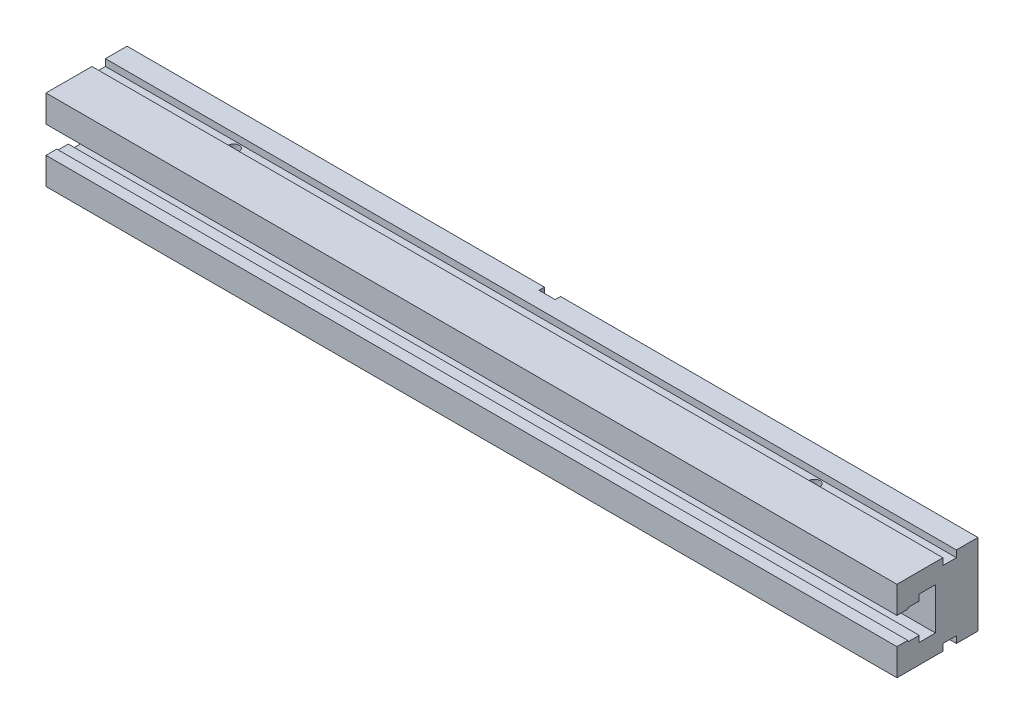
ISO-10303-21;
HEADER;
FILE_DESCRIPTION(('STEP AP214'),'2;1');
FILE_NAME('part.step','',(''),(''),'','','');
FILE_SCHEMA(('AUTOMOTIVE_DESIGN { 1 0 10303 214 1 1 1 1 }'));
ENDSEC;
DATA;
#1=APPLICATION_CONTEXT('core data for automotive mechanical design processes');
#2=APPLICATION_PROTOCOL_DEFINITION('international standard','automotive_design',2000,#1);
#3=PRODUCT_CONTEXT('',#1,'mechanical');
#4=PRODUCT('Part','Part','',(#3));
#5=PRODUCT_RELATED_PRODUCT_CATEGORY('part','',(#4));
#6=PRODUCT_DEFINITION_FORMATION('','',#4);
#7=PRODUCT_DEFINITION_CONTEXT('part definition',#1,'design');
#8=PRODUCT_DEFINITION('design','',#6,#7);
#9=PRODUCT_DEFINITION_SHAPE('','',#8);
#10=(LENGTH_UNIT() NAMED_UNIT(*) SI_UNIT(.MILLI.,.METRE.));
#11=(NAMED_UNIT(*) PLANE_ANGLE_UNIT() SI_UNIT($,.RADIAN.));
#12=(NAMED_UNIT(*) SI_UNIT($,.STERADIAN.) SOLID_ANGLE_UNIT());
#13=UNCERTAINTY_MEASURE_WITH_UNIT(LENGTH_MEASURE(1.E-05),#10,'distance_accuracy_value','');
#14=(GEOMETRIC_REPRESENTATION_CONTEXT(3) GLOBAL_UNCERTAINTY_ASSIGNED_CONTEXT((#13)) GLOBAL_UNIT_ASSIGNED_CONTEXT((#10,
#11,#12)) REPRESENTATION_CONTEXT('',''));
#15=CARTESIAN_POINT('',(0.,0.,0.));
#16=DIRECTION('',(0.,0.,1.));
#17=DIRECTION('',(1.,0.,0.));
#18=AXIS2_PLACEMENT_3D('',#15,#16,#17);
#19=CARTESIAN_POINT('',(6.,-30.0000595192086,4.));
#20=DIRECTION('',(1.,0.,0.));
#21=DIRECTION('',(0.,1.,0.));
#22=AXIS2_PLACEMENT_3D('',#19,#20,#21);
#23=PLANE('',#22);
#24=DIRECTION('',(0.,1.,0.));
#25=VECTOR('',#24,1.);
#26=CARTESIAN_POINT('',(6.,30.0000595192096,0.));
#27=LINE('',#26,#25);
#28=CARTESIAN_POINT('',(6.,-30.,0.));
#29=VERTEX_POINT('',#28);
#30=CARTESIAN_POINT('',(6.,-2.5,0.));
#31=VERTEX_POINT('',#30);
#32=EDGE_CURVE('E362',#29,#31,#27,.T.);
#33=ORIENTED_EDGE('',*,*,#32,.F.);
#34=DIRECTION('',(0.,0.,1.));
#35=VECTOR('',#34,1.);
#36=CARTESIAN_POINT('',(6.,-30.,4.));
#37=LINE('',#36,#35);
#38=CARTESIAN_POINT('',(6.,-30.,4.));
#39=VERTEX_POINT('',#38);
#40=EDGE_CURVE('E777',#29,#39,#37,.T.);
#41=ORIENTED_EDGE('',*,*,#40,.T.);
#42=DIRECTION('',(0.,1.,0.));
#43=VECTOR('',#42,1.);
#44=CARTESIAN_POINT('',(6.,-30.0000595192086,4.));
#45=LINE('',#44,#43);
#46=CARTESIAN_POINT('',(6.,-2.5,4.));
#47=VERTEX_POINT('',#46);
#48=EDGE_CURVE('E353',#39,#47,#45,.T.);
#49=ORIENTED_EDGE('',*,*,#48,.T.);
#50=DIRECTION('',(0.,0.,1.));
#51=VECTOR('',#50,1.);
#52=CARTESIAN_POINT('',(6.,-2.5,31.4999434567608));
#53=LINE('',#52,#51);
#54=EDGE_CURVE('E343',#47,#31,#53,.F.);
#55=ORIENTED_EDGE('',*,*,#54,.T.);
#56=EDGE_LOOP('',(#33,#41,#49,#55));
#57=FACE_BOUND('',#56,.T.);
#58=ADVANCED_FACE('F14',(#57),#23,.F.);
#59=CARTESIAN_POINT('',(-6.,-30.0000595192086,4.));
#60=DIRECTION('',(-1.,0.,0.));
#61=DIRECTION('',(0.,-1.,0.));
#62=AXIS2_PLACEMENT_3D('',#59,#60,#61);
#63=PLANE('',#62);
#64=DIRECTION('',(0.,-1.,0.));
#65=VECTOR('',#64,1.);
#66=CARTESIAN_POINT('',(-6.,30.0000595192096,0.));
#67=LINE('',#66,#65);
#68=CARTESIAN_POINT('',(-6.,30.,0.));
#69=VERTEX_POINT('',#68);
#70=CARTESIAN_POINT('',(-6.,2.5,0.));
#71=VERTEX_POINT('',#70);
#72=EDGE_CURVE('E359',#69,#71,#67,.T.);
#73=ORIENTED_EDGE('',*,*,#72,.F.);
#74=DIRECTION('',(0.,0.,1.));
#75=VECTOR('',#74,1.);
#76=CARTESIAN_POINT('',(-6.,30.,4.));
#77=LINE('',#76,#75);
#78=CARTESIAN_POINT('',(-6.,30.,4.));
#79=VERTEX_POINT('',#78);
#80=EDGE_CURVE('E508',#69,#79,#77,.T.);
#81=ORIENTED_EDGE('',*,*,#80,.T.);
#82=DIRECTION('',(0.,1.,0.));
#83=VECTOR('',#82,1.);
#84=CARTESIAN_POINT('',(-6.,-30.0000595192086,4.));
#85=LINE('',#84,#83);
#86=CARTESIAN_POINT('',(-6.,2.5,4.));
#87=VERTEX_POINT('',#86);
#88=EDGE_CURVE('E352',#87,#79,#85,.T.);
#89=ORIENTED_EDGE('',*,*,#88,.F.);
#90=DIRECTION('',(0.,0.,1.));
#91=VECTOR('',#90,1.);
#92=CARTESIAN_POINT('',(-6.,2.5,31.4999434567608));
#93=LINE('',#92,#91);
#94=EDGE_CURVE('E346',#87,#71,#93,.F.);
#95=ORIENTED_EDGE('',*,*,#94,.T.);
#96=EDGE_LOOP('',(#73,#81,#89,#95));
#97=FACE_BOUND('',#96,.T.);
#98=ADVANCED_FACE('F506',(#97),#63,.F.);
#99=CARTESIAN_POINT('',(6.,-30.0000595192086,4.));
#100=DIRECTION('',(0.,0.,1.));
#101=DIRECTION('',(1.,0.,0.));
#102=AXIS2_PLACEMENT_3D('',#99,#100,#101);
#103=PLANE('',#102);
#104=CARTESIAN_POINT('',(0.,17.5,4.));
#105=DIRECTION('',(0.,0.,-1.));
#106=DIRECTION('',(-1.,0.,0.));
#107=AXIS2_PLACEMENT_3D('',#104,#105,#106);
#108=CIRCLE('',#107,2.5);
#109=CARTESIAN_POINT('',(-2.5,17.5,4.));
#110=VERTEX_POINT('',#109);
#111=EDGE_CURVE('E587',#110,#110,#108,.T.);
#112=ORIENTED_EDGE('',*,*,#111,.F.);
#113=EDGE_LOOP('',(#112));
#114=FACE_BOUND('',#113,.T.);
#115=ORIENTED_EDGE('',*,*,#88,.T.);
#116=DIRECTION('',(1.,0.,0.));
#117=VECTOR('',#116,1.);
#118=CARTESIAN_POINT('',(6.,30.,4.));
#119=LINE('',#118,#117);
#120=CARTESIAN_POINT('',(6.,30.,4.));
#121=VERTEX_POINT('',#120);
#122=EDGE_CURVE('E511',#79,#121,#119,.T.);
#123=ORIENTED_EDGE('',*,*,#122,.T.);
#124=CARTESIAN_POINT('',(6.,2.5,4.));
#125=VERTEX_POINT('',#124);
#126=EDGE_CURVE('E356',#125,#121,#45,.T.);
#127=ORIENTED_EDGE('',*,*,#126,.F.);
#128=CARTESIAN_POINT('',(0.,0.,4.));
#129=DIRECTION('',(0.,0.,1.));
#130=DIRECTION('',(1.,0.,0.));
#131=AXIS2_PLACEMENT_3D('',#128,#129,#130);
#132=CIRCLE('',#131,6.5);
#133=EDGE_CURVE('E472',#125,#87,#132,.T.);
#134=ORIENTED_EDGE('',*,*,#133,.T.);
#135=EDGE_LOOP('',(#115,#123,#127,#134));
#136=FACE_BOUND('',#135,.T.);
#137=ADVANCED_FACE('F499',(#114,#136),#103,.F.);
#138=CARTESIAN_POINT('',(315.,-6.00072613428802,0.));
#139=DIRECTION('',(0.,0.,1.));
#140=DIRECTION('',(1.,0.,0.));
#141=AXIS2_PLACEMENT_3D('',#138,#139,#140);
#142=PLANE('',#141);
#143=DIRECTION('',(-1.,0.,0.));
#144=VECTOR('',#143,1.);
#145=CARTESIAN_POINT('',(250.,-6.,0.));
#146=LINE('',#145,#144);
#147=CARTESIAN_POINT('',(250.,-6.,0.));
#148=VERTEX_POINT('',#147);
#149=CARTESIAN_POINT('',(220.,-6.,0.));
#150=VERTEX_POINT('',#149);
#151=EDGE_CURVE('E533',#148,#150,#146,.T.);
#152=ORIENTED_EDGE('',*,*,#151,.F.);
#153=CARTESIAN_POINT('',(250.,0.,0.));
#154=DIRECTION('',(0.,0.,-1.));
#155=DIRECTION('',(-1.,0.,0.));
#156=AXIS2_PLACEMENT_3D('',#153,#154,#155);
#157=CIRCLE('',#156,6.);
#158=CARTESIAN_POINT('',(250.,6.,0.));
#159=VERTEX_POINT('',#158);
#160=EDGE_CURVE('E513',#159,#148,#157,.T.);
#161=ORIENTED_EDGE('',*,*,#160,.F.);
#162=DIRECTION('',(1.,0.,0.));
#163=VECTOR('',#162,1.);
#164=CARTESIAN_POINT('',(250.,6.,0.));
#165=LINE('',#164,#163);
#166=CARTESIAN_POINT('',(220.,6.,0.));
#167=VERTEX_POINT('',#166);
#168=EDGE_CURVE('E522',#167,#159,#165,.T.);
#169=ORIENTED_EDGE('',*,*,#168,.F.);
#170=CARTESIAN_POINT('',(220.,0.,0.));
#171=DIRECTION('',(0.,0.,-1.));
#172=DIRECTION('',(-1.,0.,0.));
#173=AXIS2_PLACEMENT_3D('',#170,#171,#172);
#174=CIRCLE('',#173,6.);
#175=EDGE_CURVE('E536',#150,#167,#174,.T.);
#176=ORIENTED_EDGE('',*,*,#175,.F.);
#177=EDGE_LOOP('',(#152,#161,#169,#176));
#178=FACE_BOUND('',#177,.T.);
#179=CARTESIAN_POINT('',(200.,0.,1.65978342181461E-10));
#180=DIRECTION('',(0.,0.,1.));
#181=DIRECTION('',(1.,0.,0.));
#182=AXIS2_PLACEMENT_3D('',#179,#180,#181);
#183=CIRCLE('',#182,6.5);
#184=CARTESIAN_POINT('',(206.5,0.,1.65978342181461E-10));
#185=VERTEX_POINT('',#184);
#186=EDGE_CURVE('E319',#185,#185,#183,.T.);
#187=ORIENTED_EDGE('',*,*,#186,.T.);
#188=EDGE_LOOP('',(#187));
#189=FACE_BOUND('',#188,.T.);
#190=CARTESIAN_POINT('',(6.,2.5,0.));
#191=VERTEX_POINT('',#190);
#192=CARTESIAN_POINT('',(6.,30.,0.));
#193=VERTEX_POINT('',#192);
#194=EDGE_CURVE('E361',#191,#193,#27,.T.);
#195=ORIENTED_EDGE('',*,*,#194,.T.);
#196=DIRECTION('',(1.,0.,0.));
#197=VECTOR('',#196,1.);
#198=CARTESIAN_POINT('',(315.,30.,0.));
#199=LINE('',#198,#197);
#200=CARTESIAN_POINT('',(315.,30.,0.));
#201=VERTEX_POINT('',#200);
#202=EDGE_CURVE('E29',#193,#201,#199,.T.);
#203=ORIENTED_EDGE('',*,*,#202,.T.);
#204=DIRECTION('',(0.,1.,0.));
#205=VECTOR('',#204,1.);
#206=CARTESIAN_POINT('',(315.,30.0000595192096,0.));
#207=LINE('',#206,#205);
#208=CARTESIAN_POINT('',(315.,-30.,0.));
#209=VERTEX_POINT('',#208);
#210=EDGE_CURVE('E398',#209,#201,#207,.T.);
#211=ORIENTED_EDGE('',*,*,#210,.F.);
#212=DIRECTION('',(-1.,0.,0.));
#213=VECTOR('',#212,1.);
#214=CARTESIAN_POINT('',(315.,-30.,0.));
#215=LINE('',#214,#213);
#216=EDGE_CURVE('E780',#209,#29,#215,.T.);
#217=ORIENTED_EDGE('',*,*,#216,.T.);
#218=ORIENTED_EDGE('',*,*,#32,.T.);
#219=CARTESIAN_POINT('',(0.,0.,0.));
#220=DIRECTION('',(0.,0.,-1.));
#221=DIRECTION('',(-1.,0.,0.));
#222=AXIS2_PLACEMENT_3D('',#219,#220,#221);
#223=CIRCLE('',#222,6.5);
#224=EDGE_CURVE('E302',#191,#31,#223,.T.);
#225=ORIENTED_EDGE('',*,*,#224,.F.);
#226=EDGE_LOOP('',(#195,#203,#211,#217,#218,#225));
#227=FACE_BOUND('',#226,.T.);
#228=ADVANCED_FACE('F605',(#178,#189,#227),#142,.F.);
#229=CARTESIAN_POINT('',(315.,22.9994107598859,15.9999523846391));
#230=DIRECTION('',(0.,0.,-1.));
#231=DIRECTION('',(-1.,0.,0.));
#232=AXIS2_PLACEMENT_3D('',#229,#230,#231);
#233=PLANE('',#232);
#234=DIRECTION('',(0.,-1.,0.));
#235=VECTOR('',#234,1.);
#236=CARTESIAN_POINT('',(315.,22.9994107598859,15.9999523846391));
#237=LINE('',#236,#235);
#238=CARTESIAN_POINT('',(315.,30.,15.9999523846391));
#239=VERTEX_POINT('',#238);
#240=CARTESIAN_POINT('',(315.,25.,15.9999523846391));
#241=VERTEX_POINT('',#240);
#242=EDGE_CURVE('E401',#239,#241,#237,.T.);
#243=ORIENTED_EDGE('',*,*,#242,.F.);
#244=DIRECTION('',(1.,0.,0.));
#245=VECTOR('',#244,1.);
#246=CARTESIAN_POINT('',(-315.,30.,15.9999523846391));
#247=LINE('',#246,#245);
#248=CARTESIAN_POINT('',(-315.,30.,15.9999523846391));
#249=VERTEX_POINT('',#248);
#250=EDGE_CURVE('E487',#249,#239,#247,.T.);
#251=ORIENTED_EDGE('',*,*,#250,.F.);
#252=DIRECTION('',(0.,-1.,0.));
#253=VECTOR('',#252,1.);
#254=CARTESIAN_POINT('',(-315.,22.9994107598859,15.9999523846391));
#255=LINE('',#254,#253);
#256=CARTESIAN_POINT('',(-315.,25.,15.9999523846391));
#257=VERTEX_POINT('',#256);
#258=EDGE_CURVE('E364',#249,#257,#255,.T.);
#259=ORIENTED_EDGE('',*,*,#258,.T.);
#260=DIRECTION('',(1.,0.,0.));
#261=VECTOR('',#260,1.);
#262=CARTESIAN_POINT('',(-315.,25.,15.9999523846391));
#263=LINE('',#262,#261);
#264=EDGE_CURVE('E736',#257,#241,#263,.T.);
#265=ORIENTED_EDGE('',*,*,#264,.T.);
#266=EDGE_LOOP('',(#243,#251,#259,#265));
#267=FACE_BOUND('',#266,.T.);
#268=ADVANCED_FACE('F16',(#267),#233,.F.);
#269=CARTESIAN_POINT('',(315.,9.99922625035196,60.0001190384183));
#270=DIRECTION('',(0.,0.,-1.));
#271=DIRECTION('',(-1.,0.,0.));
#272=AXIS2_PLACEMENT_3D('',#269,#270,#271);
#273=PLANE('',#272);
#274=DIRECTION('',(0.,-1.,0.));
#275=VECTOR('',#274,1.);
#276=CARTESIAN_POINT('',(315.,9.99922625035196,60.0001190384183));
#277=LINE('',#276,#275);
#278=CARTESIAN_POINT('',(315.,30.,60.0001190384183));
#279=VERTEX_POINT('',#278);
#280=CARTESIAN_POINT('',(315.,9.99922625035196,60.0001190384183));
#281=VERTEX_POINT('',#280);
#282=EDGE_CURVE('E403',#279,#281,#277,.T.);
#283=ORIENTED_EDGE('',*,*,#282,.F.);
#284=DIRECTION('',(-1.,0.,0.));
#285=VECTOR('',#284,1.);
#286=CARTESIAN_POINT('',(315.,30.,60.0001190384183));
#287=LINE('',#286,#285);
#288=CARTESIAN_POINT('',(-315.,30.,60.0001190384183));
#289=VERTEX_POINT('',#288);
#290=EDGE_CURVE('E720',#279,#289,#287,.T.);
#291=ORIENTED_EDGE('',*,*,#290,.T.);
#292=DIRECTION('',(0.,-1.,0.));
#293=VECTOR('',#292,1.);
#294=CARTESIAN_POINT('',(-315.,9.99922625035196,60.0001190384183));
#295=LINE('',#294,#293);
#296=CARTESIAN_POINT('',(-315.,9.99922625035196,60.0001190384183));
#297=VERTEX_POINT('',#296);
#298=EDGE_CURVE('E290',#289,#297,#295,.T.);
#299=ORIENTED_EDGE('',*,*,#298,.T.);
#300=DIRECTION('',(-1.,0.,0.));
#301=VECTOR('',#300,1.);
#302=CARTESIAN_POINT('',(315.,9.99922625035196,60.0001190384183));
#303=LINE('',#302,#301);
#304=EDGE_CURVE('E466',#281,#297,#303,.T.);
#305=ORIENTED_EDGE('',*,*,#304,.F.);
#306=EDGE_LOOP('',(#283,#291,#299,#305));
#307=FACE_BOUND('',#306,.T.);
#308=ADVANCED_FACE('F709',(#307),#273,.F.);
#309=CARTESIAN_POINT('',(315.,9.99922625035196,60.0001190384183));
#310=DIRECTION('',(0.,1.,0.));
#311=DIRECTION('',(-1.,0.,0.));
#312=AXIS2_PLACEMENT_3D('',#309,#310,#311);
#313=PLANE('',#312);
#314=DIRECTION('',(0.,0.,-1.));
#315=VECTOR('',#314,1.);
#316=CARTESIAN_POINT('',(-315.,9.99922625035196,60.0001190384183));
#317=LINE('',#316,#315);
#318=CARTESIAN_POINT('',(-315.,9.99922625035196,52.0007380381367));
#319=VERTEX_POINT('',#318);
#320=EDGE_CURVE('E367',#297,#319,#317,.T.);
#321=ORIENTED_EDGE('',*,*,#320,.T.);
#322=DIRECTION('',(-1.,0.,0.));
#323=VECTOR('',#322,1.);
#324=CARTESIAN_POINT('',(315.,9.99922625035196,52.0007380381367));
#325=LINE('',#324,#323);
#326=CARTESIAN_POINT('',(315.,9.99922625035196,52.0007380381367));
#327=VERTEX_POINT('',#326);
#328=EDGE_CURVE('E463',#327,#319,#325,.T.);
#329=ORIENTED_EDGE('',*,*,#328,.F.);
#330=DIRECTION('',(0.,0.,-1.));
#331=VECTOR('',#330,1.);
#332=CARTESIAN_POINT('',(315.,9.99922625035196,60.0001190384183));
#333=LINE('',#332,#331);
#334=EDGE_CURVE('E405',#281,#327,#333,.T.);
#335=ORIENTED_EDGE('',*,*,#334,.F.);
#336=ORIENTED_EDGE('',*,*,#304,.T.);
#337=EDGE_LOOP('',(#321,#329,#335,#336));
#338=FACE_BOUND('',#337,.T.);
#339=ADVANCED_FACE('F706',(#338),#313,.F.);
#340=CARTESIAN_POINT('',(315.,9.99922625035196,52.0007380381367));
#341=DIRECTION('',(0.,0.,1.));
#342=DIRECTION('',(1.,0.,0.));
#343=AXIS2_PLACEMENT_3D('',#340,#341,#342);
#344=PLANE('',#343);
#345=DIRECTION('',(0.,1.,0.));
#346=VECTOR('',#345,1.);
#347=CARTESIAN_POINT('',(-315.,9.99922625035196,52.0007380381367));
#348=LINE('',#347,#346);
#349=CARTESIAN_POINT('',(-315.,11.0003392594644,52.0007380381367));
#350=VERTEX_POINT('',#349);
#351=EDGE_CURVE('E369',#319,#350,#348,.T.);
#352=ORIENTED_EDGE('',*,*,#351,.T.);
#353=DIRECTION('',(-1.,0.,0.));
#354=VECTOR('',#353,1.);
#355=CARTESIAN_POINT('',(315.,11.0003392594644,52.0007380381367));
#356=LINE('',#355,#354);
#357=CARTESIAN_POINT('',(315.,11.0003392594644,52.0007380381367));
#358=VERTEX_POINT('',#357);
#359=EDGE_CURVE('E460',#358,#350,#356,.T.);
#360=ORIENTED_EDGE('',*,*,#359,.F.);
#361=DIRECTION('',(0.,1.,0.));
#362=VECTOR('',#361,1.);
#363=CARTESIAN_POINT('',(315.,9.99922625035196,52.0007380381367));
#364=LINE('',#363,#362);
#365=EDGE_CURVE('E407',#327,#358,#364,.T.);
#366=ORIENTED_EDGE('',*,*,#365,.F.);
#367=ORIENTED_EDGE('',*,*,#328,.T.);
#368=EDGE_LOOP('',(#352,#360,#366,#367));
#369=FACE_BOUND('',#368,.T.);
#370=ADVANCED_FACE('F702',(#369),#344,.F.);
#371=CARTESIAN_POINT('',(315.,11.0003392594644,43.5002053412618));
#372=DIRECTION('',(0.,1.,0.));
#373=DIRECTION('',(-1.,0.,0.));
#374=AXIS2_PLACEMENT_3D('',#371,#372,#373);
#375=PLANE('',#374);
#376=DIRECTION('',(0.,0.,-1.));
#377=VECTOR('',#376,1.);
#378=CARTESIAN_POINT('',(-315.,11.0003392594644,43.5002053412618));
#379=LINE('',#378,#377);
#380=CARTESIAN_POINT('',(-315.,11.0003392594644,43.5002053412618));
#381=VERTEX_POINT('',#380);
#382=EDGE_CURVE('E371',#350,#381,#379,.T.);
#383=ORIENTED_EDGE('',*,*,#382,.T.);
#384=DIRECTION('',(-1.,0.,0.));
#385=VECTOR('',#384,1.);
#386=CARTESIAN_POINT('',(315.,11.0003392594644,43.5002053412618));
#387=LINE('',#386,#385);
#388=CARTESIAN_POINT('',(315.,11.0003392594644,43.5002053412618));
#389=VERTEX_POINT('',#388);
#390=EDGE_CURVE('E457',#389,#381,#387,.T.);
#391=ORIENTED_EDGE('',*,*,#390,.F.);
#392=DIRECTION('',(0.,0.,-1.));
#393=VECTOR('',#392,1.);
#394=CARTESIAN_POINT('',(315.,11.0003392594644,43.5002053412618));
#395=LINE('',#394,#393);
#396=EDGE_CURVE('E409',#358,#389,#395,.T.);
#397=ORIENTED_EDGE('',*,*,#396,.F.);
#398=ORIENTED_EDGE('',*,*,#359,.T.);
#399=EDGE_LOOP('',(#383,#391,#397,#398));
#400=FACE_BOUND('',#399,.T.);
#401=ADVANCED_FACE('F698',(#400),#375,.F.);
#402=CARTESIAN_POINT('',(315.,11.0003392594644,43.5002053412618));
#403=DIRECTION('',(0.,0.,1.));
#404=DIRECTION('',(1.,0.,0.));
#405=AXIS2_PLACEMENT_3D('',#402,#403,#404);
#406=PLANE('',#405);
#407=DIRECTION('',(0.,1.,0.));
#408=VECTOR('',#407,1.);
#409=CARTESIAN_POINT('',(-315.,11.0003392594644,43.5002053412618));
#410=LINE('',#409,#408);
#411=CARTESIAN_POINT('',(-315.,15.4999910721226,43.5002053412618));
#412=VERTEX_POINT('',#411);
#413=EDGE_CURVE('E373',#381,#412,#410,.T.);
#414=ORIENTED_EDGE('',*,*,#413,.T.);
#415=DIRECTION('',(-1.,0.,0.));
#416=VECTOR('',#415,1.);
#417=CARTESIAN_POINT('',(315.,15.4999910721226,43.5002053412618));
#418=LINE('',#417,#416);
#419=CARTESIAN_POINT('',(315.,15.4999910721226,43.5002053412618));
#420=VERTEX_POINT('',#419);
#421=EDGE_CURVE('E454',#420,#412,#418,.T.);
#422=ORIENTED_EDGE('',*,*,#421,.F.);
#423=DIRECTION('',(0.,1.,0.));
#424=VECTOR('',#423,1.);
#425=CARTESIAN_POINT('',(315.,11.0003392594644,43.5002053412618));
#426=LINE('',#425,#424);
#427=EDGE_CURVE('E411',#389,#420,#426,.T.);
#428=ORIENTED_EDGE('',*,*,#427,.F.);
#429=ORIENTED_EDGE('',*,*,#390,.T.);
#430=EDGE_LOOP('',(#414,#422,#428,#429));
#431=FACE_BOUND('',#430,.T.);
#432=ADVANCED_FACE('F694',(#431),#406,.F.);
#433=CARTESIAN_POINT('',(315.,15.4999910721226,43.5002053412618));
#434=DIRECTION('',(0.,1.,0.));
#435=DIRECTION('',(-1.,0.,0.));
#436=AXIS2_PLACEMENT_3D('',#433,#434,#435);
#437=PLANE('',#436);
#438=DIRECTION('',(0.,0.,-1.));
#439=VECTOR('',#438,1.);
#440=CARTESIAN_POINT('',(-315.,15.4999910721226,43.5002053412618));
#441=LINE('',#440,#439);
#442=CARTESIAN_POINT('',(-315.,15.4999910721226,31.4999434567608));
#443=VERTEX_POINT('',#442);
#444=EDGE_CURVE('E375',#412,#443,#441,.T.);
#445=ORIENTED_EDGE('',*,*,#444,.T.);
#446=DIRECTION('',(-1.,0.,0.));
#447=VECTOR('',#446,1.);
#448=CARTESIAN_POINT('',(315.,15.4999910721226,31.4999434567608));
#449=LINE('',#448,#447);
#450=CARTESIAN_POINT('',(315.,15.4999910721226,31.4999434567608));
#451=VERTEX_POINT('',#450);
#452=EDGE_CURVE('E451',#451,#443,#449,.T.);
#453=ORIENTED_EDGE('',*,*,#452,.F.);
#454=DIRECTION('',(0.,0.,-1.));
#455=VECTOR('',#454,1.);
#456=CARTESIAN_POINT('',(315.,15.4999910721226,43.5002053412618));
#457=LINE('',#456,#455);
#458=EDGE_CURVE('E413',#420,#451,#457,.T.);
#459=ORIENTED_EDGE('',*,*,#458,.F.);
#460=ORIENTED_EDGE('',*,*,#421,.T.);
#461=EDGE_LOOP('',(#445,#453,#459,#460));
#462=FACE_BOUND('',#461,.T.);
#463=ADVANCED_FACE('F690',(#462),#437,.F.);
#464=CARTESIAN_POINT('',(315.,15.4999910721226,31.4999434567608));
#465=DIRECTION('',(0.,0.,-1.));
#466=DIRECTION('',(-1.,0.,0.));
#467=AXIS2_PLACEMENT_3D('',#464,#465,#466);
#468=PLANE('',#467);
#469=CARTESIAN_POINT('',(-200.,0.,31.4999434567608));
#470=DIRECTION('',(0.,0.,1.));
#471=DIRECTION('',(1.,0.,0.));
#472=AXIS2_PLACEMENT_3D('',#469,#470,#471);
#473=CIRCLE('',#472,9.5);
#474=CARTESIAN_POINT('',(-190.5,0.,31.4999434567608));
#475=VERTEX_POINT('',#474);
#476=EDGE_CURVE('E316',#475,#475,#473,.T.);
#477=ORIENTED_EDGE('',*,*,#476,.F.);
#478=EDGE_LOOP('',(#477));
#479=FACE_BOUND('',#478,.T.);
#480=CARTESIAN_POINT('',(200.,0.,31.4999434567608));
#481=DIRECTION('',(0.,0.,1.));
#482=DIRECTION('',(1.,0.,0.));
#483=AXIS2_PLACEMENT_3D('',#480,#481,#482);
#484=CIRCLE('',#483,9.5);
#485=CARTESIAN_POINT('',(209.5,0.,31.4999434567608));
#486=VERTEX_POINT('',#485);
#487=EDGE_CURVE('E328',#486,#486,#484,.T.);
#488=ORIENTED_EDGE('',*,*,#487,.F.);
#489=EDGE_LOOP('',(#488));
#490=FACE_BOUND('',#489,.T.);
#491=CARTESIAN_POINT('',(0.,0.,31.4999434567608));
#492=DIRECTION('',(0.,0.,1.));
#493=DIRECTION('',(1.,0.,0.));
#494=AXIS2_PLACEMENT_3D('',#491,#492,#493);
#495=CIRCLE('',#494,9.5);
#496=CARTESIAN_POINT('',(9.5,0.,31.4999434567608));
#497=VERTEX_POINT('',#496);
#498=EDGE_CURVE('E337',#497,#497,#495,.T.);
#499=ORIENTED_EDGE('',*,*,#498,.F.);
#500=EDGE_LOOP('',(#499));
#501=FACE_BOUND('',#500,.T.);
#502=DIRECTION('',(0.,-1.,0.));
#503=VECTOR('',#502,1.);
#504=CARTESIAN_POINT('',(-315.,15.4999910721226,31.4999434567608));
#505=LINE('',#504,#503);
#506=CARTESIAN_POINT('',(-315.,-15.4999910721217,31.4999434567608));
#507=VERTEX_POINT('',#506);
#508=EDGE_CURVE('E377',#443,#507,#505,.T.);
#509=ORIENTED_EDGE('',*,*,#508,.T.);
#510=DIRECTION('',(-1.,0.,0.));
#511=VECTOR('',#510,1.);
#512=CARTESIAN_POINT('',(315.,-15.4999910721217,31.4999434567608));
#513=LINE('',#512,#511);
#514=CARTESIAN_POINT('',(315.,-15.4999910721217,31.4999434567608));
#515=VERTEX_POINT('',#514);
#516=EDGE_CURVE('E448',#515,#507,#513,.T.);
#517=ORIENTED_EDGE('',*,*,#516,.F.);
#518=DIRECTION('',(0.,-1.,0.));
#519=VECTOR('',#518,1.);
#520=CARTESIAN_POINT('',(315.,15.4999910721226,31.4999434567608));
#521=LINE('',#520,#519);
#522=EDGE_CURVE('E415',#451,#515,#521,.T.);
#523=ORIENTED_EDGE('',*,*,#522,.F.);
#524=ORIENTED_EDGE('',*,*,#452,.T.);
#525=EDGE_LOOP('',(#509,#517,#523,#524));
#526=FACE_BOUND('',#525,.T.);
#527=ADVANCED_FACE('F686',(#479,#490,#501,#526),#468,.F.);
#528=CARTESIAN_POINT('',(315.,-15.4999910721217,31.4999434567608));
#529=DIRECTION('',(0.,-1.,0.));
#530=DIRECTION('',(1.,0.,0.));
#531=AXIS2_PLACEMENT_3D('',#528,#529,#530);
#532=PLANE('',#531);
#533=DIRECTION('',(0.,0.,1.));
#534=VECTOR('',#533,1.);
#535=CARTESIAN_POINT('',(-315.,-15.4999910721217,31.4999434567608));
#536=LINE('',#535,#534);
#537=CARTESIAN_POINT('',(-315.,-15.4999910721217,43.5002053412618));
#538=VERTEX_POINT('',#537);
#539=EDGE_CURVE('E379',#507,#538,#536,.T.);
#540=ORIENTED_EDGE('',*,*,#539,.T.);
#541=DIRECTION('',(-1.,0.,0.));
#542=VECTOR('',#541,1.);
#543=CARTESIAN_POINT('',(315.,-15.4999910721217,43.5002053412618));
#544=LINE('',#543,#542);
#545=CARTESIAN_POINT('',(315.,-15.4999910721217,43.5002053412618));
#546=VERTEX_POINT('',#545);
#547=EDGE_CURVE('E445',#546,#538,#544,.T.);
#548=ORIENTED_EDGE('',*,*,#547,.F.);
#549=DIRECTION('',(0.,0.,1.));
#550=VECTOR('',#549,1.);
#551=CARTESIAN_POINT('',(315.,-15.4999910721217,31.4999434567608));
#552=LINE('',#551,#550);
#553=EDGE_CURVE('E417',#515,#546,#552,.T.);
#554=ORIENTED_EDGE('',*,*,#553,.F.);
#555=ORIENTED_EDGE('',*,*,#516,.T.);
#556=EDGE_LOOP('',(#540,#548,#554,#555));
#557=FACE_BOUND('',#556,.T.);
#558=ADVANCED_FACE('F682',(#557),#532,.F.);
#559=CARTESIAN_POINT('',(315.,-15.4999910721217,43.5002053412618));
#560=DIRECTION('',(0.,0.,1.));
#561=DIRECTION('',(1.,0.,0.));
#562=AXIS2_PLACEMENT_3D('',#559,#560,#561);
#563=PLANE('',#562);
#564=DIRECTION('',(0.,1.,0.));
#565=VECTOR('',#564,1.);
#566=CARTESIAN_POINT('',(-315.,-15.4999910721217,43.5002053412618));
#567=LINE('',#566,#565);
#568=CARTESIAN_POINT('',(-315.,-11.0003392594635,43.5002053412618));
#569=VERTEX_POINT('',#568);
#570=EDGE_CURVE('E381',#538,#569,#567,.T.);
#571=ORIENTED_EDGE('',*,*,#570,.T.);
#572=DIRECTION('',(-1.,0.,0.));
#573=VECTOR('',#572,1.);
#574=CARTESIAN_POINT('',(315.,-11.0003392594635,43.5002053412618));
#575=LINE('',#574,#573);
#576=CARTESIAN_POINT('',(315.,-11.0003392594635,43.5002053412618));
#577=VERTEX_POINT('',#576);
#578=EDGE_CURVE('E442',#577,#569,#575,.T.);
#579=ORIENTED_EDGE('',*,*,#578,.F.);
#580=DIRECTION('',(0.,1.,0.));
#581=VECTOR('',#580,1.);
#582=CARTESIAN_POINT('',(315.,-15.4999910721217,43.5002053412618));
#583=LINE('',#582,#581);
#584=EDGE_CURVE('E419',#546,#577,#583,.T.);
#585=ORIENTED_EDGE('',*,*,#584,.F.);
#586=ORIENTED_EDGE('',*,*,#547,.T.);
#587=EDGE_LOOP('',(#571,#579,#585,#586));
#588=FACE_BOUND('',#587,.T.);
#589=ADVANCED_FACE('F678',(#588),#563,.F.);
#590=CARTESIAN_POINT('',(315.,-11.0003392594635,43.5002053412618));
#591=DIRECTION('',(0.,-1.,0.));
#592=DIRECTION('',(1.,0.,0.));
#593=AXIS2_PLACEMENT_3D('',#590,#591,#592);
#594=PLANE('',#593);
#595=DIRECTION('',(0.,0.,1.));
#596=VECTOR('',#595,1.);
#597=CARTESIAN_POINT('',(-315.,-11.0003392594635,43.5002053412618));
#598=LINE('',#597,#596);
#599=CARTESIAN_POINT('',(-315.,-11.0003392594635,52.0007380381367));
#600=VERTEX_POINT('',#599);
#601=EDGE_CURVE('E383',#569,#600,#598,.T.);
#602=ORIENTED_EDGE('',*,*,#601,.T.);
#603=DIRECTION('',(-1.,0.,0.));
#604=VECTOR('',#603,1.);
#605=CARTESIAN_POINT('',(315.,-11.0003392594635,52.0007380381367));
#606=LINE('',#605,#604);
#607=CARTESIAN_POINT('',(315.,-11.0003392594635,52.0007380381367));
#608=VERTEX_POINT('',#607);
#609=EDGE_CURVE('E439',#608,#600,#606,.T.);
#610=ORIENTED_EDGE('',*,*,#609,.F.);
#611=DIRECTION('',(0.,0.,1.));
#612=VECTOR('',#611,1.);
#613=CARTESIAN_POINT('',(315.,-11.0003392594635,43.5002053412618));
#614=LINE('',#613,#612);
#615=EDGE_CURVE('E421',#577,#608,#614,.T.);
#616=ORIENTED_EDGE('',*,*,#615,.F.);
#617=ORIENTED_EDGE('',*,*,#578,.T.);
#618=EDGE_LOOP('',(#602,#610,#616,#617));
#619=FACE_BOUND('',#618,.T.);
#620=ADVANCED_FACE('F674',(#619),#594,.F.);
#621=CARTESIAN_POINT('',(315.,-10.0004166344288,52.0007380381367));
#622=DIRECTION('',(0.,0.,1.));
#623=DIRECTION('',(1.,0.,0.));
#624=AXIS2_PLACEMENT_3D('',#621,#622,#623);
#625=PLANE('',#624);
#626=DIRECTION('',(0.,1.,0.));
#627=VECTOR('',#626,1.);
#628=CARTESIAN_POINT('',(-315.,-10.0004166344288,52.0007380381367));
#629=LINE('',#628,#627);
#630=CARTESIAN_POINT('',(-315.,-10.0004166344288,52.0007380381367));
#631=VERTEX_POINT('',#630);
#632=EDGE_CURVE('E385',#600,#631,#629,.T.);
#633=ORIENTED_EDGE('',*,*,#632,.T.);
#634=DIRECTION('',(-1.,0.,0.));
#635=VECTOR('',#634,1.);
#636=CARTESIAN_POINT('',(315.,-10.0004166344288,52.0007380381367));
#637=LINE('',#636,#635);
#638=CARTESIAN_POINT('',(315.,-10.0004166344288,52.0007380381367));
#639=VERTEX_POINT('',#638);
#640=EDGE_CURVE('E436',#639,#631,#637,.T.);
#641=ORIENTED_EDGE('',*,*,#640,.F.);
#642=DIRECTION('',(0.,1.,0.));
#643=VECTOR('',#642,1.);
#644=CARTESIAN_POINT('',(315.,-10.0004166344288,52.0007380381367));
#645=LINE('',#644,#643);
#646=EDGE_CURVE('E423',#608,#639,#645,.T.);
#647=ORIENTED_EDGE('',*,*,#646,.F.);
#648=ORIENTED_EDGE('',*,*,#609,.T.);
#649=EDGE_LOOP('',(#633,#641,#647,#648));
#650=FACE_BOUND('',#649,.T.);
#651=ADVANCED_FACE('F670',(#650),#625,.F.);
#652=CARTESIAN_POINT('',(315.,-10.0004166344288,52.0007380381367));
#653=DIRECTION('',(0.,-1.,0.));
#654=DIRECTION('',(1.,0.,0.));
#655=AXIS2_PLACEMENT_3D('',#652,#653,#654);
#656=PLANE('',#655);
#657=DIRECTION('',(0.,0.,1.));
#658=VECTOR('',#657,1.);
#659=CARTESIAN_POINT('',(-315.,-10.0004166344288,52.0007380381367));
#660=LINE('',#659,#658);
#661=CARTESIAN_POINT('',(-315.,-10.0004166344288,60.0001190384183));
#662=VERTEX_POINT('',#661);
#663=EDGE_CURVE('E387',#631,#662,#660,.T.);
#664=ORIENTED_EDGE('',*,*,#663,.T.);
#665=DIRECTION('',(-1.,0.,0.));
#666=VECTOR('',#665,1.);
#667=CARTESIAN_POINT('',(315.,-10.0004166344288,60.0001190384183));
#668=LINE('',#667,#666);
#669=CARTESIAN_POINT('',(315.,-10.0004166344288,60.0001190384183));
#670=VERTEX_POINT('',#669);
#671=EDGE_CURVE('E433',#670,#662,#668,.T.);
#672=ORIENTED_EDGE('',*,*,#671,.F.);
#673=DIRECTION('',(0.,0.,1.));
#674=VECTOR('',#673,1.);
#675=CARTESIAN_POINT('',(315.,-10.0004166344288,52.0007380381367));
#676=LINE('',#675,#674);
#677=EDGE_CURVE('E425',#639,#670,#676,.T.);
#678=ORIENTED_EDGE('',*,*,#677,.F.);
#679=ORIENTED_EDGE('',*,*,#640,.T.);
#680=EDGE_LOOP('',(#664,#672,#678,#679));
#681=FACE_BOUND('',#680,.T.);
#682=ADVANCED_FACE('F666',(#681),#656,.F.);
#683=CARTESIAN_POINT('',(315.,-30.0000595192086,60.0001190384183));
#684=DIRECTION('',(0.,0.,-1.));
#685=DIRECTION('',(-1.,0.,0.));
#686=AXIS2_PLACEMENT_3D('',#683,#684,#685);
#687=PLANE('',#686);
#688=DIRECTION('',(0.,-1.,0.));
#689=VECTOR('',#688,1.);
#690=CARTESIAN_POINT('',(-315.,-30.0000595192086,60.0001190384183));
#691=LINE('',#690,#689);
#692=CARTESIAN_POINT('',(-315.,-30.,60.0001190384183));
#693=VERTEX_POINT('',#692);
#694=EDGE_CURVE('E389',#662,#693,#691,.T.);
#695=ORIENTED_EDGE('',*,*,#694,.T.);
#696=DIRECTION('',(1.,0.,0.));
#697=VECTOR('',#696,1.);
#698=CARTESIAN_POINT('',(315.,-30.,60.0001190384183));
#699=LINE('',#698,#697);
#700=CARTESIAN_POINT('',(315.,-30.,60.0001190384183));
#701=VERTEX_POINT('',#700);
#702=EDGE_CURVE('E770',#693,#701,#699,.T.);
#703=ORIENTED_EDGE('',*,*,#702,.T.);
#704=DIRECTION('',(0.,-1.,0.));
#705=VECTOR('',#704,1.);
#706=CARTESIAN_POINT('',(315.,-30.0000595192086,60.0001190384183));
#707=LINE('',#706,#705);
#708=EDGE_CURVE('E427',#670,#701,#707,.T.);
#709=ORIENTED_EDGE('',*,*,#708,.F.);
#710=ORIENTED_EDGE('',*,*,#671,.T.);
#711=EDGE_LOOP('',(#695,#703,#709,#710));
#712=FACE_BOUND('',#711,.T.);
#713=ADVANCED_FACE('F662',(#712),#687,.F.);
#714=CARTESIAN_POINT('',(315.,-23.0006011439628,15.9999523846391));
#715=DIRECTION('',(0.,0.,-1.));
#716=DIRECTION('',(-1.,0.,0.));
#717=AXIS2_PLACEMENT_3D('',#714,#715,#716);
#718=PLANE('',#717);
#719=DIRECTION('',(0.,-1.,0.));
#720=VECTOR('',#719,1.);
#721=CARTESIAN_POINT('',(-315.,-23.0006011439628,15.9999523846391));
#722=LINE('',#721,#720);
#723=CARTESIAN_POINT('',(-315.,-25.,15.9999523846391));
#724=VERTEX_POINT('',#723);
#725=CARTESIAN_POINT('',(-315.,-30.,15.9999523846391));
#726=VERTEX_POINT('',#725);
#727=EDGE_CURVE('E392',#724,#726,#722,.T.);
#728=ORIENTED_EDGE('',*,*,#727,.T.);
#729=DIRECTION('',(1.,0.,0.));
#730=VECTOR('',#729,1.);
#731=CARTESIAN_POINT('',(-315.,-30.,15.9999523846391));
#732=LINE('',#731,#730);
#733=CARTESIAN_POINT('',(315.,-30.,15.9999523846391));
#734=VERTEX_POINT('',#733);
#735=EDGE_CURVE('E750',#726,#734,#732,.T.);
#736=ORIENTED_EDGE('',*,*,#735,.T.);
#737=DIRECTION('',(0.,-1.,0.));
#738=VECTOR('',#737,1.);
#739=CARTESIAN_POINT('',(315.,-23.0006011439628,15.9999523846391));
#740=LINE('',#739,#738);
#741=CARTESIAN_POINT('',(315.,-25.,15.9999523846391));
#742=VERTEX_POINT('',#741);
#743=EDGE_CURVE('E430',#742,#734,#740,.T.);
#744=ORIENTED_EDGE('',*,*,#743,.F.);
#745=DIRECTION('',(1.,0.,0.));
#746=VECTOR('',#745,1.);
#747=CARTESIAN_POINT('',(-315.,-25.,15.9999523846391));
#748=LINE('',#747,#746);
#749=EDGE_CURVE('E760',#724,#742,#748,.T.);
#750=ORIENTED_EDGE('',*,*,#749,.F.);
#751=EDGE_LOOP('',(#728,#736,#744,#750));
#752=FACE_BOUND('',#751,.T.);
#753=ADVANCED_FACE('F658',(#752),#718,.F.);
#754=DIRECTION('',(-1.,0.,0.));
#755=VECTOR('',#754,1.);
#756=CARTESIAN_POINT('',(-220.,-6.,0.));
#757=LINE('',#756,#755);
#758=CARTESIAN_POINT('',(-220.,-6.,0.));
#759=VERTEX_POINT('',#758);
#760=CARTESIAN_POINT('',(-250.,-6.,0.));
#761=VERTEX_POINT('',#760);
#762=EDGE_CURVE('E563',#759,#761,#757,.T.);
#763=ORIENTED_EDGE('',*,*,#762,.F.);
#764=CARTESIAN_POINT('',(-220.,0.,0.));
#765=DIRECTION('',(0.,0.,-1.));
#766=DIRECTION('',(-1.,0.,0.));
#767=AXIS2_PLACEMENT_3D('',#764,#765,#766);
#768=CIRCLE('',#767,6.);
#769=CARTESIAN_POINT('',(-220.,6.,0.));
#770=VERTEX_POINT('',#769);
#771=EDGE_CURVE('E481',#770,#759,#768,.T.);
#772=ORIENTED_EDGE('',*,*,#771,.F.);
#773=DIRECTION('',(1.,0.,0.));
#774=VECTOR('',#773,1.);
#775=CARTESIAN_POINT('',(-220.,6.,0.));
#776=LINE('',#775,#774);
#777=CARTESIAN_POINT('',(-250.,6.,0.));
#778=VERTEX_POINT('',#777);
#779=EDGE_CURVE('E552',#778,#770,#776,.T.);
#780=ORIENTED_EDGE('',*,*,#779,.F.);
#781=CARTESIAN_POINT('',(-250.,0.,0.));
#782=DIRECTION('',(0.,0.,-1.));
#783=DIRECTION('',(-1.,0.,0.));
#784=AXIS2_PLACEMENT_3D('',#781,#782,#783);
#785=CIRCLE('',#784,6.);
#786=EDGE_CURVE('E566',#761,#778,#785,.T.);
#787=ORIENTED_EDGE('',*,*,#786,.F.);
#788=EDGE_LOOP('',(#763,#772,#780,#787));
#789=FACE_BOUND('',#788,.T.);
#790=CARTESIAN_POINT('',(-200.,0.,1.65978342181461E-10));
#791=DIRECTION('',(0.,0.,1.));
#792=DIRECTION('',(1.,0.,0.));
#793=AXIS2_PLACEMENT_3D('',#790,#791,#792);
#794=CIRCLE('',#793,6.5);
#795=CARTESIAN_POINT('',(-193.5,0.,1.65978342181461E-10));
#796=VERTEX_POINT('',#795);
#797=EDGE_CURVE('E307',#796,#796,#794,.T.);
#798=ORIENTED_EDGE('',*,*,#797,.T.);
#799=EDGE_LOOP('',(#798));
#800=FACE_BOUND('',#799,.T.);
#801=DIRECTION('',(0.,1.,0.));
#802=VECTOR('',#801,1.);
#803=CARTESIAN_POINT('',(-315.,-6.00072613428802,0.));
#804=LINE('',#803,#802);
#805=CARTESIAN_POINT('',(-315.,-30.,0.));
#806=VERTEX_POINT('',#805);
#807=CARTESIAN_POINT('',(-315.,30.,0.));
#808=VERTEX_POINT('',#807);
#809=EDGE_CURVE('E395',#806,#808,#804,.T.);
#810=ORIENTED_EDGE('',*,*,#809,.T.);
#811=DIRECTION('',(1.,0.,0.));
#812=VECTOR('',#811,1.);
#813=CARTESIAN_POINT('',(315.,30.,0.));
#814=LINE('',#813,#812);
#815=EDGE_CURVE('E510',#808,#69,#814,.T.);
#816=ORIENTED_EDGE('',*,*,#815,.T.);
#817=ORIENTED_EDGE('',*,*,#72,.T.);
#818=CARTESIAN_POINT('',(-6.,-2.5,0.));
#819=VERTEX_POINT('',#818);
#820=EDGE_CURVE('E593',#819,#71,#223,.T.);
#821=ORIENTED_EDGE('',*,*,#820,.F.);
#822=CARTESIAN_POINT('',(-6.,-30.,0.));
#823=VERTEX_POINT('',#822);
#824=EDGE_CURVE('E355',#819,#823,#67,.T.);
#825=ORIENTED_EDGE('',*,*,#824,.T.);
#826=DIRECTION('',(-1.,0.,0.));
#827=VECTOR('',#826,1.);
#828=CARTESIAN_POINT('',(315.,-30.,0.));
#829=LINE('',#828,#827);
#830=EDGE_CURVE('E774',#823,#806,#829,.T.);
#831=ORIENTED_EDGE('',*,*,#830,.T.);
#832=EDGE_LOOP('',(#810,#816,#817,#821,#825,#831));
#833=FACE_BOUND('',#832,.T.);
#834=ADVANCED_FACE('F652',(#789,#800,#833),#142,.F.);
#835=CARTESIAN_POINT('',(315.,5.99953575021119,0.));
#836=DIRECTION('',(-1.,0.,0.));
#837=DIRECTION('',(0.,-1.,0.));
#838=AXIS2_PLACEMENT_3D('',#835,#836,#837);
#839=PLANE('',#838);
#840=ORIENTED_EDGE('',*,*,#210,.T.);
#841=DIRECTION('',(0.,0.,-1.));
#842=VECTOR('',#841,1.);
#843=CARTESIAN_POINT('',(315.,30.,-5.50220546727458));
#844=LINE('',#843,#842);
#845=EDGE_CURVE('E292',#239,#201,#844,.T.);
#846=ORIENTED_EDGE('',*,*,#845,.F.);
#847=ORIENTED_EDGE('',*,*,#242,.T.);
#848=DIRECTION('',(0.,0.,-1.));
#849=VECTOR('',#848,1.);
#850=CARTESIAN_POINT('',(315.,25.,15.9999523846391));
#851=LINE('',#850,#849);
#852=CARTESIAN_POINT('',(315.,25.,25.9999523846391));
#853=VERTEX_POINT('',#852);
#854=EDGE_CURVE('E724',#853,#241,#851,.T.);
#855=ORIENTED_EDGE('',*,*,#854,.F.);
#856=DIRECTION('',(0.,1.,0.));
#857=VECTOR('',#856,1.);
#858=CARTESIAN_POINT('',(315.,25.0000595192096,25.9999523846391));
#859=LINE('',#858,#857);
#860=CARTESIAN_POINT('',(315.,30.,25.9999523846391));
#861=VERTEX_POINT('',#860);
#862=EDGE_CURVE('E298',#853,#861,#859,.T.);
#863=ORIENTED_EDGE('',*,*,#862,.T.);
#864=DIRECTION('',(0.,0.,-1.));
#865=VECTOR('',#864,1.);
#866=CARTESIAN_POINT('',(315.,30.,25.9999523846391));
#867=LINE('',#866,#865);
#868=EDGE_CURVE('E275',#279,#861,#867,.T.);
#869=ORIENTED_EDGE('',*,*,#868,.F.);
#870=ORIENTED_EDGE('',*,*,#282,.T.);
#871=ORIENTED_EDGE('',*,*,#334,.T.);
#872=ORIENTED_EDGE('',*,*,#365,.T.);
#873=ORIENTED_EDGE('',*,*,#396,.T.);
#874=ORIENTED_EDGE('',*,*,#427,.T.);
#875=ORIENTED_EDGE('',*,*,#458,.T.);
#876=ORIENTED_EDGE('',*,*,#522,.T.);
#877=ORIENTED_EDGE('',*,*,#553,.T.);
#878=ORIENTED_EDGE('',*,*,#584,.T.);
#879=ORIENTED_EDGE('',*,*,#615,.T.);
#880=ORIENTED_EDGE('',*,*,#646,.T.);
#881=ORIENTED_EDGE('',*,*,#677,.T.);
#882=ORIENTED_EDGE('',*,*,#708,.T.);
#883=DIRECTION('',(0.,0.,1.));
#884=VECTOR('',#883,1.);
#885=CARTESIAN_POINT('',(315.,-30.,25.9999523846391));
#886=LINE('',#885,#884);
#887=CARTESIAN_POINT('',(315.,-30.,25.9999523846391));
#888=VERTEX_POINT('',#887);
#889=EDGE_CURVE('E744',#888,#701,#886,.T.);
#890=ORIENTED_EDGE('',*,*,#889,.F.);
#891=DIRECTION('',(0.,1.,0.));
#892=VECTOR('',#891,1.);
#893=CARTESIAN_POINT('',(315.,-25.0000595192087,25.9999523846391));
#894=LINE('',#893,#892);
#895=CARTESIAN_POINT('',(315.,-25.,25.9999523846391));
#896=VERTEX_POINT('',#895);
#897=EDGE_CURVE('E297',#888,#896,#894,.T.);
#898=ORIENTED_EDGE('',*,*,#897,.T.);
#899=DIRECTION('',(0.,0.,1.));
#900=VECTOR('',#899,1.);
#901=CARTESIAN_POINT('',(315.,-25.,15.9999523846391));
#902=LINE('',#901,#900);
#903=EDGE_CURVE('E753',#742,#896,#902,.T.);
#904=ORIENTED_EDGE('',*,*,#903,.F.);
#905=ORIENTED_EDGE('',*,*,#743,.T.);
#906=DIRECTION('',(0.,0.,1.));
#907=VECTOR('',#906,1.);
#908=CARTESIAN_POINT('',(315.,-30.,-5.50220546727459));
#909=LINE('',#908,#907);
#910=EDGE_CURVE('E751',#209,#734,#909,.T.);
#911=ORIENTED_EDGE('',*,*,#910,.F.);
#912=EDGE_LOOP('',(#840,#846,#847,#855,#863,#869,#870,#871,#872,#873,#874,#875,#876,#877,#878,
#879,#880,#881,#882,#890,#898,#904,#905,#911));
#913=FACE_BOUND('',#912,.T.);
#914=ADVANCED_FACE('F647',(#913),#839,.F.);
#915=CARTESIAN_POINT('',(-315.,5.99953575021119,0.));
#916=DIRECTION('',(-1.,0.,0.));
#917=DIRECTION('',(0.,-1.,0.));
#918=AXIS2_PLACEMENT_3D('',#915,#916,#917);
#919=PLANE('',#918);
#920=DIRECTION('',(0.,0.,-1.));
#921=VECTOR('',#920,1.);
#922=CARTESIAN_POINT('',(-315.,30.,-5.50220546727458));
#923=LINE('',#922,#921);
#924=EDGE_CURVE('E280',#249,#808,#923,.T.);
#925=ORIENTED_EDGE('',*,*,#924,.T.);
#926=ORIENTED_EDGE('',*,*,#809,.F.);
#927=DIRECTION('',(0.,0.,1.));
#928=VECTOR('',#927,1.);
#929=CARTESIAN_POINT('',(-315.,-30.,-5.50220546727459));
#930=LINE('',#929,#928);
#931=EDGE_CURVE('E740',#806,#726,#930,.T.);
#932=ORIENTED_EDGE('',*,*,#931,.T.);
#933=ORIENTED_EDGE('',*,*,#727,.F.);
#934=DIRECTION('',(0.,0.,1.));
#935=VECTOR('',#934,1.);
#936=CARTESIAN_POINT('',(-315.,-25.,15.9999523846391));
#937=LINE('',#936,#935);
#938=CARTESIAN_POINT('',(-315.,-25.,25.9999523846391));
#939=VERTEX_POINT('',#938);
#940=EDGE_CURVE('E743',#724,#939,#937,.T.);
#941=ORIENTED_EDGE('',*,*,#940,.T.);
#942=DIRECTION('',(0.,1.,0.));
#943=VECTOR('',#942,1.);
#944=CARTESIAN_POINT('',(-315.,-25.0000595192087,25.9999523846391));
#945=LINE('',#944,#943);
#946=CARTESIAN_POINT('',(-315.,-30.,25.9999523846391));
#947=VERTEX_POINT('',#946);
#948=EDGE_CURVE('E300',#947,#939,#945,.T.);
#949=ORIENTED_EDGE('',*,*,#948,.F.);
#950=DIRECTION('',(0.,0.,1.));
#951=VECTOR('',#950,1.);
#952=CARTESIAN_POINT('',(-315.,-30.,25.9999523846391));
#953=LINE('',#952,#951);
#954=EDGE_CURVE('E747',#947,#693,#953,.T.);
#955=ORIENTED_EDGE('',*,*,#954,.T.);
#956=ORIENTED_EDGE('',*,*,#694,.F.);
#957=ORIENTED_EDGE('',*,*,#663,.F.);
#958=ORIENTED_EDGE('',*,*,#632,.F.);
#959=ORIENTED_EDGE('',*,*,#601,.F.);
#960=ORIENTED_EDGE('',*,*,#570,.F.);
#961=ORIENTED_EDGE('',*,*,#539,.F.);
#962=ORIENTED_EDGE('',*,*,#508,.F.);
#963=ORIENTED_EDGE('',*,*,#444,.F.);
#964=ORIENTED_EDGE('',*,*,#413,.F.);
#965=ORIENTED_EDGE('',*,*,#382,.F.);
#966=ORIENTED_EDGE('',*,*,#351,.F.);
#967=ORIENTED_EDGE('',*,*,#320,.F.);
#968=ORIENTED_EDGE('',*,*,#298,.F.);
#969=DIRECTION('',(0.,0.,-1.));
#970=VECTOR('',#969,1.);
#971=CARTESIAN_POINT('',(-315.,30.,25.9999523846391));
#972=LINE('',#971,#970);
#973=CARTESIAN_POINT('',(-315.,30.,25.9999523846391));
#974=VERTEX_POINT('',#973);
#975=EDGE_CURVE('E272',#289,#974,#972,.T.);
#976=ORIENTED_EDGE('',*,*,#975,.T.);
#977=DIRECTION('',(0.,1.,0.));
#978=VECTOR('',#977,1.);
#979=CARTESIAN_POINT('',(-315.,25.0000595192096,25.9999523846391));
#980=LINE('',#979,#978);
#981=CARTESIAN_POINT('',(-315.,25.,25.9999523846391));
#982=VERTEX_POINT('',#981);
#983=EDGE_CURVE('E287',#982,#974,#980,.T.);
#984=ORIENTED_EDGE('',*,*,#983,.F.);
#985=DIRECTION('',(0.,0.,-1.));
#986=VECTOR('',#985,1.);
#987=CARTESIAN_POINT('',(-315.,25.,15.9999523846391));
#988=LINE('',#987,#986);
#989=EDGE_CURVE('E291',#982,#257,#988,.T.);
#990=ORIENTED_EDGE('',*,*,#989,.T.);
#991=ORIENTED_EDGE('',*,*,#258,.F.);
#992=EDGE_LOOP('',(#925,#926,#932,#933,#941,#949,#955,#956,#957,#958,#959,#960,#961,#962,#963,
#964,#965,#966,#967,#968,#976,#984,#990,#991));
#993=FACE_BOUND('',#992,.T.);
#994=ADVANCED_FACE('F285',(#993),#919,.T.);
#995=ORIENTED_EDGE('',*,*,#126,.T.);
#996=DIRECTION('',(0.,0.,-1.));
#997=VECTOR('',#996,1.);
#998=CARTESIAN_POINT('',(6.,30.,4.));
#999=LINE('',#998,#997);
#1000=EDGE_CURVE('E9',#121,#193,#999,.T.);
#1001=ORIENTED_EDGE('',*,*,#1000,.T.);
#1002=ORIENTED_EDGE('',*,*,#194,.F.);
#1003=DIRECTION('',(0.,0.,1.));
#1004=VECTOR('',#1003,1.);
#1005=CARTESIAN_POINT('',(6.,2.5,31.4999434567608));
#1006=LINE('',#1005,#1004);
#1007=EDGE_CURVE('E349',#191,#125,#1006,.T.);
#1008=ORIENTED_EDGE('',*,*,#1007,.T.);
#1009=EDGE_LOOP('',(#995,#1001,#1002,#1008));
#1010=FACE_BOUND('',#1009,.T.);
#1011=ADVANCED_FACE('F609',(#1010),#23,.F.);
#1012=CARTESIAN_POINT('',(-6.,-30.,4.));
#1013=VERTEX_POINT('',#1012);
#1014=CARTESIAN_POINT('',(-6.,-2.5,4.));
#1015=VERTEX_POINT('',#1014);
#1016=EDGE_CURVE('E357',#1013,#1015,#85,.T.);
#1017=ORIENTED_EDGE('',*,*,#1016,.F.);
#1018=DIRECTION('',(0.,0.,-1.));
#1019=VECTOR('',#1018,1.);
#1020=CARTESIAN_POINT('',(-6.,-30.,4.));
#1021=LINE('',#1020,#1019);
#1022=EDGE_CURVE('E36',#1013,#823,#1021,.T.);
#1023=ORIENTED_EDGE('',*,*,#1022,.T.);
#1024=ORIENTED_EDGE('',*,*,#824,.F.);
#1025=DIRECTION('',(0.,0.,1.));
#1026=VECTOR('',#1025,1.);
#1027=CARTESIAN_POINT('',(-6.,-2.5,31.4999434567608));
#1028=LINE('',#1027,#1026);
#1029=EDGE_CURVE('E340',#819,#1015,#1028,.T.);
#1030=ORIENTED_EDGE('',*,*,#1029,.T.);
#1031=EDGE_LOOP('',(#1017,#1023,#1024,#1030));
#1032=FACE_BOUND('',#1031,.T.);
#1033=ADVANCED_FACE('F637',(#1032),#63,.F.);
#1034=CARTESIAN_POINT('',(0.,-17.5,4.));
#1035=DIRECTION('',(0.,0.,-1.));
#1036=DIRECTION('',(-1.,0.,0.));
#1037=AXIS2_PLACEMENT_3D('',#1034,#1035,#1036);
#1038=CIRCLE('',#1037,2.5);
#1039=CARTESIAN_POINT('',(-2.5,-17.5,4.));
#1040=VERTEX_POINT('',#1039);
#1041=EDGE_CURVE('E583',#1040,#1040,#1038,.T.);
#1042=ORIENTED_EDGE('',*,*,#1041,.F.);
#1043=EDGE_LOOP('',(#1042));
#1044=FACE_BOUND('',#1043,.T.);
#1045=ORIENTED_EDGE('',*,*,#48,.F.);
#1046=DIRECTION('',(-1.,0.,0.));
#1047=VECTOR('',#1046,1.);
#1048=CARTESIAN_POINT('',(6.,-30.,4.));
#1049=LINE('',#1048,#1047);
#1050=EDGE_CURVE('E22',#39,#1013,#1049,.T.);
#1051=ORIENTED_EDGE('',*,*,#1050,.T.);
#1052=ORIENTED_EDGE('',*,*,#1016,.T.);
#1053=EDGE_CURVE('E469',#1015,#47,#132,.T.);
#1054=ORIENTED_EDGE('',*,*,#1053,.T.);
#1055=EDGE_LOOP('',(#1045,#1051,#1052,#1054));
#1056=FACE_BOUND('',#1055,.T.);
#1057=ADVANCED_FACE('F645',(#1044,#1056),#103,.F.);
#1058=CARTESIAN_POINT('',(0.,0.,31.4999434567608));
#1059=DIRECTION('',(0.,0.,1.));
#1060=DIRECTION('',(1.,0.,0.));
#1061=AXIS2_PLACEMENT_3D('',#1058,#1059,#1060);
#1062=CYLINDRICAL_SURFACE('',#1061,6.5);
#1063=ORIENTED_EDGE('',*,*,#1007,.F.);
#1064=ORIENTED_EDGE('',*,*,#224,.T.);
#1065=ORIENTED_EDGE('',*,*,#54,.F.);
#1066=ORIENTED_EDGE('',*,*,#1053,.F.);
#1067=ORIENTED_EDGE('',*,*,#1029,.F.);
#1068=ORIENTED_EDGE('',*,*,#820,.T.);
#1069=ORIENTED_EDGE('',*,*,#94,.F.);
#1070=ORIENTED_EDGE('',*,*,#133,.F.);
#1071=EDGE_LOOP('',(#1063,#1064,#1065,#1066,#1067,#1068,#1069,#1070));
#1072=FACE_BOUND('',#1071,.T.);
#1073=CARTESIAN_POINT('',(0.,0.,18.4999434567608));
#1074=DIRECTION('',(0.,0.,1.));
#1075=DIRECTION('',(1.,0.,0.));
#1076=AXIS2_PLACEMENT_3D('',#1073,#1074,#1075);
#1077=CIRCLE('',#1076,6.5);
#1078=CARTESIAN_POINT('',(6.5,0.,18.4999434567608));
#1079=VERTEX_POINT('',#1078);
#1080=EDGE_CURVE('E331',#1079,#1079,#1077,.T.);
#1081=ORIENTED_EDGE('',*,*,#1080,.T.);
#1082=EDGE_LOOP('',(#1081));
#1083=FACE_BOUND('',#1082,.T.);
#1084=ADVANCED_FACE('F599',(#1072,#1083),#1062,.F.);
#1085=CARTESIAN_POINT('',(0.,0.,31.4999434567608));
#1086=DIRECTION('',(0.,0.,1.));
#1087=DIRECTION('',(1.,0.,0.));
#1088=AXIS2_PLACEMENT_3D('',#1085,#1086,#1087);
#1089=CYLINDRICAL_SURFACE('',#1088,9.5);
#1090=CARTESIAN_POINT('',(0.,0.,18.4999434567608));
#1091=DIRECTION('',(0.,0.,1.));
#1092=DIRECTION('',(1.,0.,0.));
#1093=AXIS2_PLACEMENT_3D('',#1090,#1091,#1092);
#1094=CIRCLE('',#1093,9.5);
#1095=CARTESIAN_POINT('',(9.5,0.,18.4999434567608));
#1096=VERTEX_POINT('',#1095);
#1097=EDGE_CURVE('E334',#1096,#1096,#1094,.T.);
#1098=ORIENTED_EDGE('',*,*,#1097,.F.);
#1099=EDGE_LOOP('',(#1098));
#1100=FACE_BOUND('',#1099,.T.);
#1101=ORIENTED_EDGE('',*,*,#498,.T.);
#1102=EDGE_LOOP('',(#1101));
#1103=FACE_BOUND('',#1102,.T.);
#1104=ADVANCED_FACE('F800',(#1100,#1103),#1089,.F.);
#1105=CARTESIAN_POINT('',(0.,6.5,18.4999434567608));
#1106=DIRECTION('',(0.,0.,-1.));
#1107=DIRECTION('',(-1.,0.,0.));
#1108=AXIS2_PLACEMENT_3D('',#1105,#1106,#1107);
#1109=PLANE('',#1108);
#1110=ORIENTED_EDGE('',*,*,#1080,.F.);
#1111=EDGE_LOOP('',(#1110));
#1112=FACE_BOUND('',#1111,.T.);
#1113=ORIENTED_EDGE('',*,*,#1097,.T.);
#1114=EDGE_LOOP('',(#1113));
#1115=FACE_BOUND('',#1114,.T.);
#1116=ADVANCED_FACE('F865',(#1112,#1115),#1109,.F.);
#1117=CARTESIAN_POINT('',(200.,0.,31.4999434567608));
#1118=DIRECTION('',(0.,0.,1.));
#1119=DIRECTION('',(1.,0.,0.));
#1120=AXIS2_PLACEMENT_3D('',#1117,#1118,#1119);
#1121=CYLINDRICAL_SURFACE('',#1120,6.5);
#1122=ORIENTED_EDGE('',*,*,#186,.F.);
#1123=EDGE_LOOP('',(#1122));
#1124=FACE_BOUND('',#1123,.T.);
#1125=CARTESIAN_POINT('',(200.,0.,18.4999434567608));
#1126=DIRECTION('',(0.,0.,1.));
#1127=DIRECTION('',(1.,0.,0.));
#1128=AXIS2_PLACEMENT_3D('',#1125,#1126,#1127);
#1129=CIRCLE('',#1128,6.5);
#1130=CARTESIAN_POINT('',(206.5,0.,18.4999434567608));
#1131=VERTEX_POINT('',#1130);
#1132=EDGE_CURVE('E322',#1131,#1131,#1129,.T.);
#1133=ORIENTED_EDGE('',*,*,#1132,.T.);
#1134=EDGE_LOOP('',(#1133));
#1135=FACE_BOUND('',#1134,.T.);
#1136=ADVANCED_FACE('F861',(#1124,#1135),#1121,.F.);
#1137=CARTESIAN_POINT('',(200.,0.,31.4999434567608));
#1138=DIRECTION('',(0.,0.,1.));
#1139=DIRECTION('',(1.,0.,0.));
#1140=AXIS2_PLACEMENT_3D('',#1137,#1138,#1139);
#1141=CYLINDRICAL_SURFACE('',#1140,9.5);
#1142=CARTESIAN_POINT('',(200.,0.,18.4999434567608));
#1143=DIRECTION('',(0.,0.,1.));
#1144=DIRECTION('',(1.,0.,0.));
#1145=AXIS2_PLACEMENT_3D('',#1142,#1143,#1144);
#1146=CIRCLE('',#1145,9.5);
#1147=CARTESIAN_POINT('',(209.5,0.,18.4999434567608));
#1148=VERTEX_POINT('',#1147);
#1149=EDGE_CURVE('E325',#1148,#1148,#1146,.T.);
#1150=ORIENTED_EDGE('',*,*,#1149,.F.);
#1151=EDGE_LOOP('',(#1150));
#1152=FACE_BOUND('',#1151,.T.);
#1153=ORIENTED_EDGE('',*,*,#487,.T.);
#1154=EDGE_LOOP('',(#1153));
#1155=FACE_BOUND('',#1154,.T.);
#1156=ADVANCED_FACE('F864',(#1152,#1155),#1141,.F.);
#1157=CARTESIAN_POINT('',(200.,6.5,18.4999434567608));
#1158=DIRECTION('',(0.,0.,-1.));
#1159=DIRECTION('',(-1.,0.,0.));
#1160=AXIS2_PLACEMENT_3D('',#1157,#1158,#1159);
#1161=PLANE('',#1160);
#1162=ORIENTED_EDGE('',*,*,#1132,.F.);
#1163=EDGE_LOOP('',(#1162));
#1164=FACE_BOUND('',#1163,.T.);
#1165=ORIENTED_EDGE('',*,*,#1149,.T.);
#1166=EDGE_LOOP('',(#1165));
#1167=FACE_BOUND('',#1166,.T.);
#1168=ADVANCED_FACE('F853',(#1164,#1167),#1161,.F.);
#1169=CARTESIAN_POINT('',(-200.,0.,31.4999434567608));
#1170=DIRECTION('',(0.,0.,1.));
#1171=DIRECTION('',(1.,0.,0.));
#1172=AXIS2_PLACEMENT_3D('',#1169,#1170,#1171);
#1173=CYLINDRICAL_SURFACE('',#1172,6.5);
#1174=ORIENTED_EDGE('',*,*,#797,.F.);
#1175=EDGE_LOOP('',(#1174));
#1176=FACE_BOUND('',#1175,.T.);
#1177=CARTESIAN_POINT('',(-200.,0.,18.4999434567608));
#1178=DIRECTION('',(0.,0.,1.));
#1179=DIRECTION('',(1.,0.,0.));
#1180=AXIS2_PLACEMENT_3D('',#1177,#1178,#1179);
#1181=CIRCLE('',#1180,6.5);
#1182=CARTESIAN_POINT('',(-193.5,0.,18.4999434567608));
#1183=VERTEX_POINT('',#1182);
#1184=EDGE_CURVE('E310',#1183,#1183,#1181,.T.);
#1185=ORIENTED_EDGE('',*,*,#1184,.T.);
#1186=EDGE_LOOP('',(#1185));
#1187=FACE_BOUND('',#1186,.T.);
#1188=ADVANCED_FACE('F849',(#1176,#1187),#1173,.F.);
#1189=CARTESIAN_POINT('',(-200.,0.,31.4999434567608));
#1190=DIRECTION('',(0.,0.,1.));
#1191=DIRECTION('',(1.,0.,0.));
#1192=AXIS2_PLACEMENT_3D('',#1189,#1190,#1191);
#1193=CYLINDRICAL_SURFACE('',#1192,9.5);
#1194=CARTESIAN_POINT('',(-200.,0.,18.4999434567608));
#1195=DIRECTION('',(0.,0.,1.));
#1196=DIRECTION('',(1.,0.,0.));
#1197=AXIS2_PLACEMENT_3D('',#1194,#1195,#1196);
#1198=CIRCLE('',#1197,9.5);
#1199=CARTESIAN_POINT('',(-190.5,0.,18.4999434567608));
#1200=VERTEX_POINT('',#1199);
#1201=EDGE_CURVE('E313',#1200,#1200,#1198,.T.);
#1202=ORIENTED_EDGE('',*,*,#1201,.F.);
#1203=EDGE_LOOP('',(#1202));
#1204=FACE_BOUND('',#1203,.T.);
#1205=ORIENTED_EDGE('',*,*,#476,.T.);
#1206=EDGE_LOOP('',(#1205));
#1207=FACE_BOUND('',#1206,.T.);
#1208=ADVANCED_FACE('F852',(#1204,#1207),#1193,.F.);
#1209=CARTESIAN_POINT('',(-200.,6.5,18.4999434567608));
#1210=DIRECTION('',(0.,0.,-1.));
#1211=DIRECTION('',(-1.,0.,0.));
#1212=AXIS2_PLACEMENT_3D('',#1209,#1210,#1211);
#1213=PLANE('',#1212);
#1214=ORIENTED_EDGE('',*,*,#1184,.F.);
#1215=EDGE_LOOP('',(#1214));
#1216=FACE_BOUND('',#1215,.T.);
#1217=ORIENTED_EDGE('',*,*,#1201,.T.);
#1218=EDGE_LOOP('',(#1217));
#1219=FACE_BOUND('',#1218,.T.);
#1220=ADVANCED_FACE('F847',(#1216,#1219),#1213,.F.);
#1221=CARTESIAN_POINT('',(-335.491935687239,-25.0000595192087,25.9999523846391));
#1222=DIRECTION('',(0.,0.,-1.));
#1223=DIRECTION('',(-1.,0.,0.));
#1224=AXIS2_PLACEMENT_3D('',#1221,#1222,#1223);
#1225=PLANE('',#1224);
#1226=DIRECTION('',(1.,0.,0.));
#1227=VECTOR('',#1226,1.);
#1228=CARTESIAN_POINT('',(-315.,-30.,25.9999523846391));
#1229=LINE('',#1228,#1227);
#1230=EDGE_CURVE('E725',#947,#888,#1229,.T.);
#1231=ORIENTED_EDGE('',*,*,#1230,.F.);
#1232=ORIENTED_EDGE('',*,*,#948,.T.);
#1233=DIRECTION('',(1.,0.,0.));
#1234=VECTOR('',#1233,1.);
#1235=CARTESIAN_POINT('',(-315.,-25.,25.9999523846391));
#1236=LINE('',#1235,#1234);
#1237=EDGE_CURVE('E729',#939,#896,#1236,.T.);
#1238=ORIENTED_EDGE('',*,*,#1237,.T.);
#1239=ORIENTED_EDGE('',*,*,#897,.F.);
#1240=EDGE_LOOP('',(#1231,#1232,#1238,#1239));
#1241=FACE_BOUND('',#1240,.T.);
#1242=ADVANCED_FACE('F826',(#1241),#1225,.T.);
#1243=CARTESIAN_POINT('',(-335.491935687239,25.0000595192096,25.9999523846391));
#1244=DIRECTION('',(0.,0.,-1.));
#1245=DIRECTION('',(-1.,0.,0.));
#1246=AXIS2_PLACEMENT_3D('',#1243,#1244,#1245);
#1247=PLANE('',#1246);
#1248=DIRECTION('',(1.,0.,0.));
#1249=VECTOR('',#1248,1.);
#1250=CARTESIAN_POINT('',(-315.,30.,25.9999523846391));
#1251=LINE('',#1250,#1249);
#1252=EDGE_CURVE('E269',#974,#861,#1251,.T.);
#1253=ORIENTED_EDGE('',*,*,#1252,.T.);
#1254=ORIENTED_EDGE('',*,*,#862,.F.);
#1255=DIRECTION('',(1.,0.,0.));
#1256=VECTOR('',#1255,1.);
#1257=CARTESIAN_POINT('',(-315.,25.,25.9999523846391));
#1258=LINE('',#1257,#1256);
#1259=EDGE_CURVE('E279',#982,#853,#1258,.T.);
#1260=ORIENTED_EDGE('',*,*,#1259,.F.);
#1261=ORIENTED_EDGE('',*,*,#983,.T.);
#1262=EDGE_LOOP('',(#1253,#1254,#1260,#1261));
#1263=FACE_BOUND('',#1262,.T.);
#1264=ADVANCED_FACE('F294',(#1263),#1247,.T.);
#1265=CARTESIAN_POINT('',(0.,17.5,24.));
#1266=DIRECTION('',(0.,0.,-1.));
#1267=DIRECTION('',(-1.,0.,0.));
#1268=AXIS2_PLACEMENT_3D('',#1265,#1266,#1267);
#1269=CYLINDRICAL_SURFACE('',#1268,2.5);
#1270=CARTESIAN_POINT('',(0.,17.5,24.));
#1271=DIRECTION('',(0.,0.,-1.));
#1272=DIRECTION('',(-1.,0.,0.));
#1273=AXIS2_PLACEMENT_3D('',#1270,#1271,#1272);
#1274=CIRCLE('',#1273,2.5);
#1275=CARTESIAN_POINT('',(-2.5,17.5,24.));
#1276=VERTEX_POINT('',#1275);
#1277=EDGE_CURVE('E590',#1276,#1276,#1274,.T.);
#1278=ORIENTED_EDGE('',*,*,#1277,.F.);
#1279=EDGE_LOOP('',(#1278));
#1280=FACE_BOUND('',#1279,.T.);
#1281=ORIENTED_EDGE('',*,*,#111,.T.);
#1282=EDGE_LOOP('',(#1281));
#1283=FACE_BOUND('',#1282,.T.);
#1284=ADVANCED_FACE('F813',(#1280,#1283),#1269,.F.);
#1285=CARTESIAN_POINT('',(0.,17.5,24.));
#1286=DIRECTION('',(0.,0.,-1.));
#1287=DIRECTION('',(-1.,0.,0.));
#1288=AXIS2_PLACEMENT_3D('',#1285,#1286,#1287);
#1289=PLANE('',#1288);
#1290=ORIENTED_EDGE('',*,*,#1277,.T.);
#1291=EDGE_LOOP('',(#1290));
#1292=FACE_BOUND('',#1291,.T.);
#1293=ADVANCED_FACE('F815',(#1292),#1289,.T.);
#1294=CARTESIAN_POINT('',(0.,-17.5,24.));
#1295=DIRECTION('',(0.,0.,-1.));
#1296=DIRECTION('',(-1.,0.,0.));
#1297=AXIS2_PLACEMENT_3D('',#1294,#1295,#1296);
#1298=CYLINDRICAL_SURFACE('',#1297,2.5);
#1299=CARTESIAN_POINT('',(0.,-17.5,24.));
#1300=DIRECTION('',(0.,0.,-1.));
#1301=DIRECTION('',(-1.,0.,0.));
#1302=AXIS2_PLACEMENT_3D('',#1299,#1300,#1301);
#1303=CIRCLE('',#1302,2.5);
#1304=CARTESIAN_POINT('',(-2.5,-17.5,24.));
#1305=VERTEX_POINT('',#1304);
#1306=EDGE_CURVE('E584',#1305,#1305,#1303,.T.);
#1307=ORIENTED_EDGE('',*,*,#1306,.F.);
#1308=EDGE_LOOP('',(#1307));
#1309=FACE_BOUND('',#1308,.T.);
#1310=ORIENTED_EDGE('',*,*,#1041,.T.);
#1311=EDGE_LOOP('',(#1310));
#1312=FACE_BOUND('',#1311,.T.);
#1313=ADVANCED_FACE('F823',(#1309,#1312),#1298,.F.);
#1314=CARTESIAN_POINT('',(0.,-17.5,24.));
#1315=DIRECTION('',(0.,0.,-1.));
#1316=DIRECTION('',(-1.,0.,0.));
#1317=AXIS2_PLACEMENT_3D('',#1314,#1315,#1316);
#1318=PLANE('',#1317);
#1319=ORIENTED_EDGE('',*,*,#1306,.T.);
#1320=EDGE_LOOP('',(#1319));
#1321=FACE_BOUND('',#1320,.T.);
#1322=ADVANCED_FACE('F1238',(#1321),#1318,.T.);
#1323=CARTESIAN_POINT('',(-220.,0.,4.));
#1324=DIRECTION('',(0.,0.,-1.));
#1325=DIRECTION('',(-1.,0.,0.));
#1326=AXIS2_PLACEMENT_3D('',#1323,#1324,#1325);
#1327=PLANE('',#1326);
#1328=CARTESIAN_POINT('',(-220.,0.,4.));
#1329=DIRECTION('',(0.,0.,-1.));
#1330=DIRECTION('',(-1.,0.,0.));
#1331=AXIS2_PLACEMENT_3D('',#1328,#1329,#1330);
#1332=CIRCLE('',#1331,6.);
#1333=CARTESIAN_POINT('',(-220.,6.,4.));
#1334=VERTEX_POINT('',#1333);
#1335=CARTESIAN_POINT('',(-220.,-6.,4.));
#1336=VERTEX_POINT('',#1335);
#1337=EDGE_CURVE('E548',#1334,#1336,#1332,.T.);
#1338=ORIENTED_EDGE('',*,*,#1337,.T.);
#1339=DIRECTION('',(-1.,0.,0.));
#1340=VECTOR('',#1339,1.);
#1341=CARTESIAN_POINT('',(-220.,-6.,4.));
#1342=LINE('',#1341,#1340);
#1343=CARTESIAN_POINT('',(-250.,-6.,4.));
#1344=VERTEX_POINT('',#1343);
#1345=EDGE_CURVE('E551',#1336,#1344,#1342,.T.);
#1346=ORIENTED_EDGE('',*,*,#1345,.T.);
#1347=CARTESIAN_POINT('',(-250.,0.,4.));
#1348=DIRECTION('',(0.,0.,-1.));
#1349=DIRECTION('',(-1.,0.,0.));
#1350=AXIS2_PLACEMENT_3D('',#1347,#1348,#1349);
#1351=CIRCLE('',#1350,6.);
#1352=CARTESIAN_POINT('',(-250.,6.,4.));
#1353=VERTEX_POINT('',#1352);
#1354=EDGE_CURVE('E555',#1344,#1353,#1351,.T.);
#1355=ORIENTED_EDGE('',*,*,#1354,.T.);
#1356=DIRECTION('',(1.,0.,0.));
#1357=VECTOR('',#1356,1.);
#1358=CARTESIAN_POINT('',(-220.,6.,4.));
#1359=LINE('',#1358,#1357);
#1360=EDGE_CURVE('E558',#1353,#1334,#1359,.T.);
#1361=ORIENTED_EDGE('',*,*,#1360,.T.);
#1362=EDGE_LOOP('',(#1338,#1346,#1355,#1361));
#1363=FACE_BOUND('',#1362,.T.);
#1364=CARTESIAN_POINT('',(-235.,0.,4.));
#1365=DIRECTION('',(0.,0.,-1.));
#1366=DIRECTION('',(-1.,0.,0.));
#1367=AXIS2_PLACEMENT_3D('',#1364,#1365,#1366);
#1368=CIRCLE('',#1367,2.5);
#1369=CARTESIAN_POINT('',(-237.5,0.,4.));
#1370=VERTEX_POINT('',#1369);
#1371=EDGE_CURVE('E473',#1370,#1370,#1368,.F.);
#1372=ORIENTED_EDGE('',*,*,#1371,.T.);
#1373=EDGE_LOOP('',(#1372));
#1374=FACE_BOUND('',#1373,.T.);
#1375=ADVANCED_FACE('F1234',(#1363,#1374),#1327,.T.);
#1376=CARTESIAN_POINT('',(-220.,0.,4.));
#1377=DIRECTION('',(0.,0.,-1.));
#1378=DIRECTION('',(-1.,0.,0.));
#1379=AXIS2_PLACEMENT_3D('',#1376,#1377,#1378);
#1380=CYLINDRICAL_SURFACE('',#1379,6.);
#1381=ORIENTED_EDGE('',*,*,#771,.T.);
#1382=DIRECTION('',(0.,0.,-1.));
#1383=VECTOR('',#1382,1.);
#1384=CARTESIAN_POINT('',(-220.,-6.,4.));
#1385=LINE('',#1384,#1383);
#1386=EDGE_CURVE('E561',#1336,#759,#1385,.T.);
#1387=ORIENTED_EDGE('',*,*,#1386,.F.);
#1388=ORIENTED_EDGE('',*,*,#1337,.F.);
#1389=DIRECTION('',(0.,0.,-1.));
#1390=VECTOR('',#1389,1.);
#1391=CARTESIAN_POINT('',(-220.,6.,4.));
#1392=LINE('',#1391,#1390);
#1393=EDGE_CURVE('E477',#1334,#770,#1392,.T.);
#1394=ORIENTED_EDGE('',*,*,#1393,.T.);
#1395=EDGE_LOOP('',(#1381,#1387,#1388,#1394));
#1396=FACE_BOUND('',#1395,.T.);
#1397=ADVANCED_FACE('F1237',(#1396),#1380,.F.);
#1398=CARTESIAN_POINT('',(-220.,6.,4.));
#1399=DIRECTION('',(0.,1.,0.));
#1400=DIRECTION('',(-1.,0.,0.));
#1401=AXIS2_PLACEMENT_3D('',#1398,#1399,#1400);
#1402=PLANE('',#1401);
#1403=ORIENTED_EDGE('',*,*,#779,.T.);
#1404=ORIENTED_EDGE('',*,*,#1393,.F.);
#1405=ORIENTED_EDGE('',*,*,#1360,.F.);
#1406=DIRECTION('',(0.,0.,-1.));
#1407=VECTOR('',#1406,1.);
#1408=CARTESIAN_POINT('',(-250.,6.,4.));
#1409=LINE('',#1408,#1407);
#1410=EDGE_CURVE('E572',#1353,#778,#1409,.T.);
#1411=ORIENTED_EDGE('',*,*,#1410,.T.);
#1412=EDGE_LOOP('',(#1403,#1404,#1405,#1411));
#1413=FACE_BOUND('',#1412,.T.);
#1414=ADVANCED_FACE('F1240',(#1413),#1402,.F.);
#1415=CARTESIAN_POINT('',(-250.,0.,4.));
#1416=DIRECTION('',(0.,0.,-1.));
#1417=DIRECTION('',(-1.,0.,0.));
#1418=AXIS2_PLACEMENT_3D('',#1415,#1416,#1417);
#1419=CYLINDRICAL_SURFACE('',#1418,6.);
#1420=ORIENTED_EDGE('',*,*,#786,.T.);
#1421=ORIENTED_EDGE('',*,*,#1410,.F.);
#1422=ORIENTED_EDGE('',*,*,#1354,.F.);
#1423=DIRECTION('',(0.,0.,-1.));
#1424=VECTOR('',#1423,1.);
#1425=CARTESIAN_POINT('',(-250.,-6.,4.));
#1426=LINE('',#1425,#1424);
#1427=EDGE_CURVE('E574',#1344,#761,#1426,.T.);
#1428=ORIENTED_EDGE('',*,*,#1427,.T.);
#1429=EDGE_LOOP('',(#1420,#1421,#1422,#1428));
#1430=FACE_BOUND('',#1429,.T.);
#1431=ADVANCED_FACE('F1243',(#1430),#1419,.F.);
#1432=CARTESIAN_POINT('',(-220.,-6.,4.));
#1433=DIRECTION('',(0.,-1.,0.));
#1434=DIRECTION('',(1.,0.,0.));
#1435=AXIS2_PLACEMENT_3D('',#1432,#1433,#1434);
#1436=PLANE('',#1435);
#1437=ORIENTED_EDGE('',*,*,#762,.T.);
#1438=ORIENTED_EDGE('',*,*,#1427,.F.);
#1439=ORIENTED_EDGE('',*,*,#1345,.F.);
#1440=ORIENTED_EDGE('',*,*,#1386,.T.);
#1441=EDGE_LOOP('',(#1437,#1438,#1439,#1440));
#1442=FACE_BOUND('',#1441,.T.);
#1443=ADVANCED_FACE('F1247',(#1442),#1436,.F.);
#1444=CARTESIAN_POINT('',(-235.,0.,24.));
#1445=DIRECTION('',(0.,0.,-1.));
#1446=DIRECTION('',(-1.,0.,0.));
#1447=AXIS2_PLACEMENT_3D('',#1444,#1445,#1446);
#1448=PLANE('',#1447);
#1449=CARTESIAN_POINT('',(-235.,0.,24.));
#1450=DIRECTION('',(0.,0.,-1.));
#1451=DIRECTION('',(-1.,0.,0.));
#1452=AXIS2_PLACEMENT_3D('',#1449,#1450,#1451);
#1453=CIRCLE('',#1452,2.5);
#1454=CARTESIAN_POINT('',(-237.5,0.,24.));
#1455=VERTEX_POINT('',#1454);
#1456=EDGE_CURVE('E476',#1455,#1455,#1453,.T.);
#1457=ORIENTED_EDGE('',*,*,#1456,.T.);
#1458=EDGE_LOOP('',(#1457));
#1459=FACE_BOUND('',#1458,.T.);
#1460=ADVANCED_FACE('F1251',(#1459),#1448,.T.);
#1461=CARTESIAN_POINT('',(-235.,0.,24.));
#1462=DIRECTION('',(0.,0.,-1.));
#1463=DIRECTION('',(-1.,0.,0.));
#1464=AXIS2_PLACEMENT_3D('',#1461,#1462,#1463);
#1465=CYLINDRICAL_SURFACE('',#1464,2.5);
#1466=ORIENTED_EDGE('',*,*,#1456,.F.);
#1467=EDGE_LOOP('',(#1466));
#1468=FACE_BOUND('',#1467,.T.);
#1469=ORIENTED_EDGE('',*,*,#1371,.F.);
#1470=EDGE_LOOP('',(#1469));
#1471=FACE_BOUND('',#1470,.T.);
#1472=ADVANCED_FACE('F1216',(#1468,#1471),#1465,.F.);
#1473=CARTESIAN_POINT('',(250.,0.,4.));
#1474=DIRECTION('',(0.,0.,-1.));
#1475=DIRECTION('',(-1.,0.,0.));
#1476=AXIS2_PLACEMENT_3D('',#1473,#1474,#1475);
#1477=PLANE('',#1476);
#1478=CARTESIAN_POINT('',(250.,0.,4.));
#1479=DIRECTION('',(0.,0.,-1.));
#1480=DIRECTION('',(-1.,0.,0.));
#1481=AXIS2_PLACEMENT_3D('',#1478,#1479,#1480);
#1482=CIRCLE('',#1481,6.);
#1483=CARTESIAN_POINT('',(250.,6.,4.));
#1484=VERTEX_POINT('',#1483);
#1485=CARTESIAN_POINT('',(250.,-6.,4.));
#1486=VERTEX_POINT('',#1485);
#1487=EDGE_CURVE('E518',#1484,#1486,#1482,.T.);
#1488=ORIENTED_EDGE('',*,*,#1487,.T.);
#1489=DIRECTION('',(-1.,0.,0.));
#1490=VECTOR('',#1489,1.);
#1491=CARTESIAN_POINT('',(250.,-6.,4.));
#1492=LINE('',#1491,#1490);
#1493=CARTESIAN_POINT('',(220.,-6.,4.));
#1494=VERTEX_POINT('',#1493);
#1495=EDGE_CURVE('E521',#1486,#1494,#1492,.T.);
#1496=ORIENTED_EDGE('',*,*,#1495,.T.);
#1497=CARTESIAN_POINT('',(220.,0.,4.));
#1498=DIRECTION('',(0.,0.,-1.));
#1499=DIRECTION('',(-1.,0.,0.));
#1500=AXIS2_PLACEMENT_3D('',#1497,#1498,#1499);
#1501=CIRCLE('',#1500,6.);
#1502=CARTESIAN_POINT('',(220.,6.,4.));
#1503=VERTEX_POINT('',#1502);
#1504=EDGE_CURVE('E525',#1494,#1503,#1501,.T.);
#1505=ORIENTED_EDGE('',*,*,#1504,.T.);
#1506=DIRECTION('',(1.,0.,0.));
#1507=VECTOR('',#1506,1.);
#1508=CARTESIAN_POINT('',(250.,6.,4.));
#1509=LINE('',#1508,#1507);
#1510=EDGE_CURVE('E528',#1503,#1484,#1509,.T.);
#1511=ORIENTED_EDGE('',*,*,#1510,.T.);
#1512=EDGE_LOOP('',(#1488,#1496,#1505,#1511));
#1513=FACE_BOUND('',#1512,.T.);
#1514=CARTESIAN_POINT('',(235.,0.,4.));
#1515=DIRECTION('',(0.,0.,-1.));
#1516=DIRECTION('',(-1.,0.,0.));
#1517=AXIS2_PLACEMENT_3D('',#1514,#1515,#1516);
#1518=CIRCLE('',#1517,2.5);
#1519=CARTESIAN_POINT('',(232.5,0.,4.));
#1520=VERTEX_POINT('',#1519);
#1521=EDGE_CURVE('E478',#1520,#1520,#1518,.F.);
#1522=ORIENTED_EDGE('',*,*,#1521,.T.);
#1523=EDGE_LOOP('',(#1522));
#1524=FACE_BOUND('',#1523,.T.);
#1525=ADVANCED_FACE('F1212',(#1513,#1524),#1477,.T.);
#1526=CARTESIAN_POINT('',(250.,0.,4.));
#1527=DIRECTION('',(0.,0.,-1.));
#1528=DIRECTION('',(-1.,0.,0.));
#1529=AXIS2_PLACEMENT_3D('',#1526,#1527,#1528);
#1530=CYLINDRICAL_SURFACE('',#1529,6.);
#1531=ORIENTED_EDGE('',*,*,#160,.T.);
#1532=DIRECTION('',(0.,0.,-1.));
#1533=VECTOR('',#1532,1.);
#1534=CARTESIAN_POINT('',(250.,-6.,4.));
#1535=LINE('',#1534,#1533);
#1536=EDGE_CURVE('E531',#1486,#148,#1535,.T.);
#1537=ORIENTED_EDGE('',*,*,#1536,.F.);
#1538=ORIENTED_EDGE('',*,*,#1487,.F.);
#1539=DIRECTION('',(0.,0.,-1.));
#1540=VECTOR('',#1539,1.);
#1541=CARTESIAN_POINT('',(250.,6.,4.));
#1542=LINE('',#1541,#1540);
#1543=EDGE_CURVE('E482',#1484,#159,#1542,.T.);
#1544=ORIENTED_EDGE('',*,*,#1543,.T.);
#1545=EDGE_LOOP('',(#1531,#1537,#1538,#1544));
#1546=FACE_BOUND('',#1545,.T.);
#1547=ADVANCED_FACE('F1215',(#1546),#1530,.F.);
#1548=CARTESIAN_POINT('',(250.,6.,4.));
#1549=DIRECTION('',(0.,1.,0.));
#1550=DIRECTION('',(-1.,0.,0.));
#1551=AXIS2_PLACEMENT_3D('',#1548,#1549,#1550);
#1552=PLANE('',#1551);
#1553=ORIENTED_EDGE('',*,*,#168,.T.);
#1554=ORIENTED_EDGE('',*,*,#1543,.F.);
#1555=ORIENTED_EDGE('',*,*,#1510,.F.);
#1556=DIRECTION('',(0.,0.,-1.));
#1557=VECTOR('',#1556,1.);
#1558=CARTESIAN_POINT('',(220.,6.,4.));
#1559=LINE('',#1558,#1557);
#1560=EDGE_CURVE('E542',#1503,#167,#1559,.T.);
#1561=ORIENTED_EDGE('',*,*,#1560,.T.);
#1562=EDGE_LOOP('',(#1553,#1554,#1555,#1561));
#1563=FACE_BOUND('',#1562,.T.);
#1564=ADVANCED_FACE('F1218',(#1563),#1552,.F.);
#1565=CARTESIAN_POINT('',(220.,0.,4.));
#1566=DIRECTION('',(0.,0.,-1.));
#1567=DIRECTION('',(-1.,0.,0.));
#1568=AXIS2_PLACEMENT_3D('',#1565,#1566,#1567);
#1569=CYLINDRICAL_SURFACE('',#1568,6.);
#1570=ORIENTED_EDGE('',*,*,#175,.T.);
#1571=ORIENTED_EDGE('',*,*,#1560,.F.);
#1572=ORIENTED_EDGE('',*,*,#1504,.F.);
#1573=DIRECTION('',(0.,0.,-1.));
#1574=VECTOR('',#1573,1.);
#1575=CARTESIAN_POINT('',(220.,-6.,4.));
#1576=LINE('',#1575,#1574);
#1577=EDGE_CURVE('E544',#1494,#150,#1576,.T.);
#1578=ORIENTED_EDGE('',*,*,#1577,.T.);
#1579=EDGE_LOOP('',(#1570,#1571,#1572,#1578));
#1580=FACE_BOUND('',#1579,.T.);
#1581=ADVANCED_FACE('F1221',(#1580),#1569,.F.);
#1582=CARTESIAN_POINT('',(250.,-6.,4.));
#1583=DIRECTION('',(0.,-1.,0.));
#1584=DIRECTION('',(1.,0.,0.));
#1585=AXIS2_PLACEMENT_3D('',#1582,#1583,#1584);
#1586=PLANE('',#1585);
#1587=ORIENTED_EDGE('',*,*,#151,.T.);
#1588=ORIENTED_EDGE('',*,*,#1577,.F.);
#1589=ORIENTED_EDGE('',*,*,#1495,.F.);
#1590=ORIENTED_EDGE('',*,*,#1536,.T.);
#1591=EDGE_LOOP('',(#1587,#1588,#1589,#1590));
#1592=FACE_BOUND('',#1591,.T.);
#1593=ADVANCED_FACE('F1225',(#1592),#1586,.F.);
#1594=CARTESIAN_POINT('',(235.,0.,24.));
#1595=DIRECTION('',(0.,0.,-1.));
#1596=DIRECTION('',(-1.,0.,0.));
#1597=AXIS2_PLACEMENT_3D('',#1594,#1595,#1596);
#1598=PLANE('',#1597);
#1599=CARTESIAN_POINT('',(235.,0.,24.));
#1600=DIRECTION('',(0.,0.,-1.));
#1601=DIRECTION('',(-1.,0.,0.));
#1602=AXIS2_PLACEMENT_3D('',#1599,#1600,#1601);
#1603=CIRCLE('',#1602,2.5);
#1604=CARTESIAN_POINT('',(232.5,0.,24.));
#1605=VERTEX_POINT('',#1604);
#1606=EDGE_CURVE('E580',#1605,#1605,#1603,.T.);
#1607=ORIENTED_EDGE('',*,*,#1606,.T.);
#1608=EDGE_LOOP('',(#1607));
#1609=FACE_BOUND('',#1608,.T.);
#1610=ADVANCED_FACE('F1229',(#1609),#1598,.T.);
#1611=CARTESIAN_POINT('',(235.,0.,24.));
#1612=DIRECTION('',(0.,0.,-1.));
#1613=DIRECTION('',(-1.,0.,0.));
#1614=AXIS2_PLACEMENT_3D('',#1611,#1612,#1613);
#1615=CYLINDRICAL_SURFACE('',#1614,2.5);
#1616=ORIENTED_EDGE('',*,*,#1606,.F.);
#1617=EDGE_LOOP('',(#1616));
#1618=FACE_BOUND('',#1617,.T.);
#1619=ORIENTED_EDGE('',*,*,#1521,.F.);
#1620=EDGE_LOOP('',(#1619));
#1621=FACE_BOUND('',#1620,.T.);
#1622=ADVANCED_FACE('F925',(#1618,#1621),#1615,.F.);
#1623=CARTESIAN_POINT('',(-315.,-25.,15.9999523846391));
#1624=DIRECTION('',(0.,1.,0.));
#1625=DIRECTION('',(0.,0.,1.));
#1626=AXIS2_PLACEMENT_3D('',#1623,#1624,#1625);
#1627=PLANE('',#1626);
#1628=CARTESIAN_POINT('',(215.,-25.,20.9999523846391));
#1629=DIRECTION('',(0.,1.,0.));
#1630=DIRECTION('',(0.,0.,1.));
#1631=AXIS2_PLACEMENT_3D('',#1628,#1629,#1630);
#1632=CIRCLE('',#1631,4.);
#1633=CARTESIAN_POINT('',(215.,-25.,24.9999523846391));
#1634=VERTEX_POINT('',#1633);
#1635=EDGE_CURVE('E483',#1634,#1634,#1632,.F.);
#1636=ORIENTED_EDGE('',*,*,#1635,.F.);
#1637=EDGE_LOOP('',(#1636));
#1638=FACE_BOUND('',#1637,.T.);
#1639=ORIENTED_EDGE('',*,*,#903,.T.);
#1640=ORIENTED_EDGE('',*,*,#1237,.F.);
#1641=ORIENTED_EDGE('',*,*,#940,.F.);
#1642=ORIENTED_EDGE('',*,*,#749,.T.);
#1643=EDGE_LOOP('',(#1639,#1640,#1641,#1642));
#1644=FACE_BOUND('',#1643,.T.);
#1645=CARTESIAN_POINT('',(-215.,-25.,20.9999523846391));
#1646=DIRECTION('',(0.,1.,0.));
#1647=DIRECTION('',(0.,0.,1.));
#1648=AXIS2_PLACEMENT_3D('',#1645,#1646,#1647);
#1649=CIRCLE('',#1648,4.);
#1650=CARTESIAN_POINT('',(-215.,-25.,24.9999523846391));
#1651=VERTEX_POINT('',#1650);
#1652=EDGE_CURVE('E486',#1651,#1651,#1649,.F.);
#1653=ORIENTED_EDGE('',*,*,#1652,.F.);
#1654=EDGE_LOOP('',(#1653));
#1655=FACE_BOUND('',#1654,.T.);
#1656=ADVANCED_FACE('F835',(#1638,#1644,#1655),#1627,.F.);
#1657=CARTESIAN_POINT('',(-215.,-5.00005951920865,20.9999523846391));
#1658=DIRECTION('',(0.,-1.,0.));
#1659=DIRECTION('',(1.,0.,0.));
#1660=AXIS2_PLACEMENT_3D('',#1657,#1658,#1659);
#1661=CYLINDRICAL_SURFACE('',#1660,4.);
#1662=ORIENTED_EDGE('',*,*,#1652,.T.);
#1663=EDGE_LOOP('',(#1662));
#1664=FACE_BOUND('',#1663,.T.);
#1665=CARTESIAN_POINT('',(-215.,-5.,20.9999523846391));
#1666=DIRECTION('',(0.,-1.,0.));
#1667=DIRECTION('',(0.,0.,-1.));
#1668=AXIS2_PLACEMENT_3D('',#1665,#1666,#1667);
#1669=CIRCLE('',#1668,4.);
#1670=CARTESIAN_POINT('',(-215.,-5.,16.9999523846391));
#1671=VERTEX_POINT('',#1670);
#1672=EDGE_CURVE('E932',#1671,#1671,#1669,.T.);
#1673=ORIENTED_EDGE('',*,*,#1672,.F.);
#1674=EDGE_LOOP('',(#1673));
#1675=FACE_BOUND('',#1674,.T.);
#1676=ADVANCED_FACE('F831',(#1664,#1675),#1661,.F.);
#1677=CARTESIAN_POINT('',(-315.,25.,15.9999523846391));
#1678=DIRECTION('',(0.,-1.,0.));
#1679=DIRECTION('',(0.,0.,-1.));
#1680=AXIS2_PLACEMENT_3D('',#1677,#1678,#1679);
#1681=PLANE('',#1680);
#1682=CARTESIAN_POINT('',(-215.,25.,20.9999523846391));
#1683=DIRECTION('',(0.,-1.,0.));
#1684=DIRECTION('',(0.,0.,-1.));
#1685=AXIS2_PLACEMENT_3D('',#1682,#1683,#1684);
#1686=CIRCLE('',#1685,4.);
#1687=CARTESIAN_POINT('',(-215.,25.,16.9999523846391));
#1688=VERTEX_POINT('',#1687);
#1689=EDGE_CURVE('E488',#1688,#1688,#1686,.F.);
#1690=ORIENTED_EDGE('',*,*,#1689,.F.);
#1691=EDGE_LOOP('',(#1690));
#1692=FACE_BOUND('',#1691,.T.);
#1693=ORIENTED_EDGE('',*,*,#854,.T.);
#1694=ORIENTED_EDGE('',*,*,#264,.F.);
#1695=ORIENTED_EDGE('',*,*,#989,.F.);
#1696=ORIENTED_EDGE('',*,*,#1259,.T.);
#1697=EDGE_LOOP('',(#1693,#1694,#1695,#1696));
#1698=FACE_BOUND('',#1697,.T.);
#1699=CARTESIAN_POINT('',(215.,25.,20.9999523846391));
#1700=DIRECTION('',(0.,-1.,0.));
#1701=DIRECTION('',(0.,0.,-1.));
#1702=AXIS2_PLACEMENT_3D('',#1699,#1700,#1701);
#1703=CIRCLE('',#1702,4.);
#1704=CARTESIAN_POINT('',(215.,25.,16.9999523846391));
#1705=VERTEX_POINT('',#1704);
#1706=EDGE_CURVE('E490',#1705,#1705,#1703,.F.);
#1707=ORIENTED_EDGE('',*,*,#1706,.F.);
#1708=EDGE_LOOP('',(#1707));
#1709=FACE_BOUND('',#1708,.T.);
#1710=ADVANCED_FACE('F834',(#1692,#1698,#1709),#1681,.F.);
#1711=CARTESIAN_POINT('',(215.,5.0000595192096,20.9999523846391));
#1712=DIRECTION('',(0.,1.,0.));
#1713=DIRECTION('',(-1.,0.,0.));
#1714=AXIS2_PLACEMENT_3D('',#1711,#1712,#1713);
#1715=CYLINDRICAL_SURFACE('',#1714,4.);
#1716=ORIENTED_EDGE('',*,*,#1706,.T.);
#1717=EDGE_LOOP('',(#1716));
#1718=FACE_BOUND('',#1717,.T.);
#1719=CARTESIAN_POINT('',(215.,5.,20.9999523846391));
#1720=DIRECTION('',(0.,1.,0.));
#1721=DIRECTION('',(0.,0.,1.));
#1722=AXIS2_PLACEMENT_3D('',#1719,#1720,#1721);
#1723=CIRCLE('',#1722,4.);
#1724=CARTESIAN_POINT('',(215.,5.,24.9999523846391));
#1725=VERTEX_POINT('',#1724);
#1726=EDGE_CURVE('E934',#1725,#1725,#1723,.T.);
#1727=ORIENTED_EDGE('',*,*,#1726,.F.);
#1728=EDGE_LOOP('',(#1727));
#1729=FACE_BOUND('',#1728,.T.);
#1730=ADVANCED_FACE('F841',(#1718,#1729),#1715,.F.);
#1731=CARTESIAN_POINT('',(-315.,30.,25.9999523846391));
#1732=DIRECTION('',(0.,-1.,0.));
#1733=DIRECTION('',(0.,0.,-1.));
#1734=AXIS2_PLACEMENT_3D('',#1731,#1732,#1733);
#1735=PLANE('',#1734);
#1736=ORIENTED_EDGE('',*,*,#868,.T.);
#1737=ORIENTED_EDGE('',*,*,#1252,.F.);
#1738=ORIENTED_EDGE('',*,*,#975,.F.);
#1739=ORIENTED_EDGE('',*,*,#290,.F.);
#1740=EDGE_LOOP('',(#1736,#1737,#1738,#1739));
#1741=FACE_BOUND('',#1740,.T.);
#1742=ADVANCED_FACE('F271',(#1741),#1735,.F.);
#1743=CARTESIAN_POINT('',(-315.,-30.,25.9999523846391));
#1744=DIRECTION('',(0.,1.,0.));
#1745=DIRECTION('',(0.,0.,1.));
#1746=AXIS2_PLACEMENT_3D('',#1743,#1744,#1745);
#1747=PLANE('',#1746);
#1748=ORIENTED_EDGE('',*,*,#954,.F.);
#1749=ORIENTED_EDGE('',*,*,#1230,.T.);
#1750=ORIENTED_EDGE('',*,*,#889,.T.);
#1751=ORIENTED_EDGE('',*,*,#702,.F.);
#1752=EDGE_LOOP('',(#1748,#1749,#1750,#1751));
#1753=FACE_BOUND('',#1752,.T.);
#1754=ADVANCED_FACE('F625',(#1753),#1747,.F.);
#1755=CARTESIAN_POINT('',(-315.,-30.,-5.50220546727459));
#1756=DIRECTION('',(0.,1.,0.));
#1757=DIRECTION('',(0.,0.,1.));
#1758=AXIS2_PLACEMENT_3D('',#1755,#1756,#1757);
#1759=PLANE('',#1758);
#1760=ORIENTED_EDGE('',*,*,#910,.T.);
#1761=ORIENTED_EDGE('',*,*,#735,.F.);
#1762=ORIENTED_EDGE('',*,*,#931,.F.);
#1763=ORIENTED_EDGE('',*,*,#830,.F.);
#1764=ORIENTED_EDGE('',*,*,#1022,.F.);
#1765=ORIENTED_EDGE('',*,*,#1050,.F.);
#1766=ORIENTED_EDGE('',*,*,#40,.F.);
#1767=ORIENTED_EDGE('',*,*,#216,.F.);
#1768=EDGE_LOOP('',(#1760,#1761,#1762,#1763,#1764,#1765,#1766,#1767));
#1769=FACE_BOUND('',#1768,.T.);
#1770=ADVANCED_FACE('F614',(#1769),#1759,.F.);
#1771=CARTESIAN_POINT('',(-315.,30.,-5.50220546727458));
#1772=DIRECTION('',(0.,-1.,0.));
#1773=DIRECTION('',(0.,0.,-1.));
#1774=AXIS2_PLACEMENT_3D('',#1771,#1772,#1773);
#1775=PLANE('',#1774);
#1776=ORIENTED_EDGE('',*,*,#924,.F.);
#1777=ORIENTED_EDGE('',*,*,#250,.T.);
#1778=ORIENTED_EDGE('',*,*,#845,.T.);
#1779=ORIENTED_EDGE('',*,*,#202,.F.);
#1780=ORIENTED_EDGE('',*,*,#1000,.F.);
#1781=ORIENTED_EDGE('',*,*,#122,.F.);
#1782=ORIENTED_EDGE('',*,*,#80,.F.);
#1783=ORIENTED_EDGE('',*,*,#815,.F.);
#1784=EDGE_LOOP('',(#1776,#1777,#1778,#1779,#1780,#1781,#1782,#1783));
#1785=FACE_BOUND('',#1784,.T.);
#1786=ADVANCED_FACE('F610',(#1785),#1775,.F.);
#1787=CARTESIAN_POINT('',(215.,-5.00005951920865,20.9999523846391));
#1788=DIRECTION('',(0.,-1.,0.));
#1789=DIRECTION('',(1.,0.,0.));
#1790=AXIS2_PLACEMENT_3D('',#1787,#1788,#1789);
#1791=CYLINDRICAL_SURFACE('',#1790,4.);
#1792=ORIENTED_EDGE('',*,*,#1635,.T.);
#1793=EDGE_LOOP('',(#1792));
#1794=FACE_BOUND('',#1793,.T.);
#1795=CARTESIAN_POINT('',(215.,-5.,20.9999523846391));
#1796=DIRECTION('',(0.,-1.,0.));
#1797=DIRECTION('',(0.,0.,-1.));
#1798=AXIS2_PLACEMENT_3D('',#1795,#1796,#1797);
#1799=CIRCLE('',#1798,4.);
#1800=CARTESIAN_POINT('',(215.,-5.,16.9999523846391));
#1801=VERTEX_POINT('',#1800);
#1802=EDGE_CURVE('E935',#1801,#1801,#1799,.T.);
#1803=ORIENTED_EDGE('',*,*,#1802,.F.);
#1804=EDGE_LOOP('',(#1803));
#1805=FACE_BOUND('',#1804,.T.);
#1806=ADVANCED_FACE('F613',(#1794,#1805),#1791,.F.);
#1807=CARTESIAN_POINT('',(-215.,5.0000595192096,20.9999523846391));
#1808=DIRECTION('',(0.,1.,0.));
#1809=DIRECTION('',(-1.,0.,0.));
#1810=AXIS2_PLACEMENT_3D('',#1807,#1808,#1809);
#1811=CYLINDRICAL_SURFACE('',#1810,4.);
#1812=ORIENTED_EDGE('',*,*,#1689,.T.);
#1813=EDGE_LOOP('',(#1812));
#1814=FACE_BOUND('',#1813,.T.);
#1815=CARTESIAN_POINT('',(-215.,5.,20.9999523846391));
#1816=DIRECTION('',(0.,1.,0.));
#1817=DIRECTION('',(0.,0.,1.));
#1818=AXIS2_PLACEMENT_3D('',#1815,#1816,#1817);
#1819=CIRCLE('',#1818,4.);
#1820=CARTESIAN_POINT('',(-215.,5.,24.9999523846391));
#1821=VERTEX_POINT('',#1820);
#1822=EDGE_CURVE('E754',#1821,#1821,#1819,.T.);
#1823=ORIENTED_EDGE('',*,*,#1822,.F.);
#1824=EDGE_LOOP('',(#1823));
#1825=FACE_BOUND('',#1824,.T.);
#1826=ADVANCED_FACE('F622',(#1814,#1825),#1811,.F.);
#1827=CARTESIAN_POINT('',(-215.,5.,20.9999523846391));
#1828=DIRECTION('',(0.,1.,0.));
#1829=DIRECTION('',(0.,0.,1.));
#1830=AXIS2_PLACEMENT_3D('',#1827,#1828,#1829);
#1831=PLANE('',#1830);
#1832=ORIENTED_EDGE('',*,*,#1822,.T.);
#1833=EDGE_LOOP('',(#1832));
#1834=FACE_BOUND('',#1833,.T.);
#1835=ADVANCED_FACE('F839',(#1834),#1831,.T.);
#1836=CARTESIAN_POINT('',(215.,5.,20.9999523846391));
#1837=DIRECTION('',(0.,1.,0.));
#1838=DIRECTION('',(0.,0.,1.));
#1839=AXIS2_PLACEMENT_3D('',#1836,#1837,#1838);
#1840=PLANE('',#1839);
#1841=ORIENTED_EDGE('',*,*,#1726,.T.);
#1842=EDGE_LOOP('',(#1841));
#1843=FACE_BOUND('',#1842,.T.);
#1844=ADVANCED_FACE('F953',(#1843),#1840,.T.);
#1845=CARTESIAN_POINT('',(215.,-5.,20.9999523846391));
#1846=DIRECTION('',(0.,-1.,0.));
#1847=DIRECTION('',(0.,0.,-1.));
#1848=AXIS2_PLACEMENT_3D('',#1845,#1846,#1847);
#1849=PLANE('',#1848);
#1850=ORIENTED_EDGE('',*,*,#1802,.T.);
#1851=EDGE_LOOP('',(#1850));
#1852=FACE_BOUND('',#1851,.T.);
#1853=ADVANCED_FACE('F955',(#1852),#1849,.T.);
#1854=CARTESIAN_POINT('',(-215.,-5.,20.9999523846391));
#1855=DIRECTION('',(0.,-1.,0.));
#1856=DIRECTION('',(0.,0.,-1.));
#1857=AXIS2_PLACEMENT_3D('',#1854,#1855,#1856);
#1858=PLANE('',#1857);
#1859=ORIENTED_EDGE('',*,*,#1672,.T.);
#1860=EDGE_LOOP('',(#1859));
#1861=FACE_BOUND('',#1860,.T.);
#1862=ADVANCED_FACE('F961',(#1861),#1858,.T.);
#1863=CLOSED_SHELL('',(#58,#98,#137,#228,#268,#308,#339,#370,#401,#432,#463,#527,#558,#589,#620,
#651,#682,#713,#753,#834,#914,#994,#1011,#1033,#1057,#1084,#1104,#1116,#1136,#1156,#1168,#1188,
#1208,#1220,#1242,#1264,#1284,#1293,#1313,#1322,#1375,#1397,#1414,#1431,#1443,#1460,#1472,#1525,
#1547,#1564,#1581,#1593,#1610,#1622,#1656,#1676,#1710,#1730,#1742,#1754,#1770,#1786,#1806,#1826,
#1835,#1844,#1853,#1862));
#1864=MANIFOLD_SOLID_BREP('B1',#1863);
#1865=ADVANCED_BREP_SHAPE_REPRESENTATION('',(#18,#1864),#14);
#1866=SHAPE_DEFINITION_REPRESENTATION(#9,#1865);
ENDSEC;
END-ISO-10303-21;
